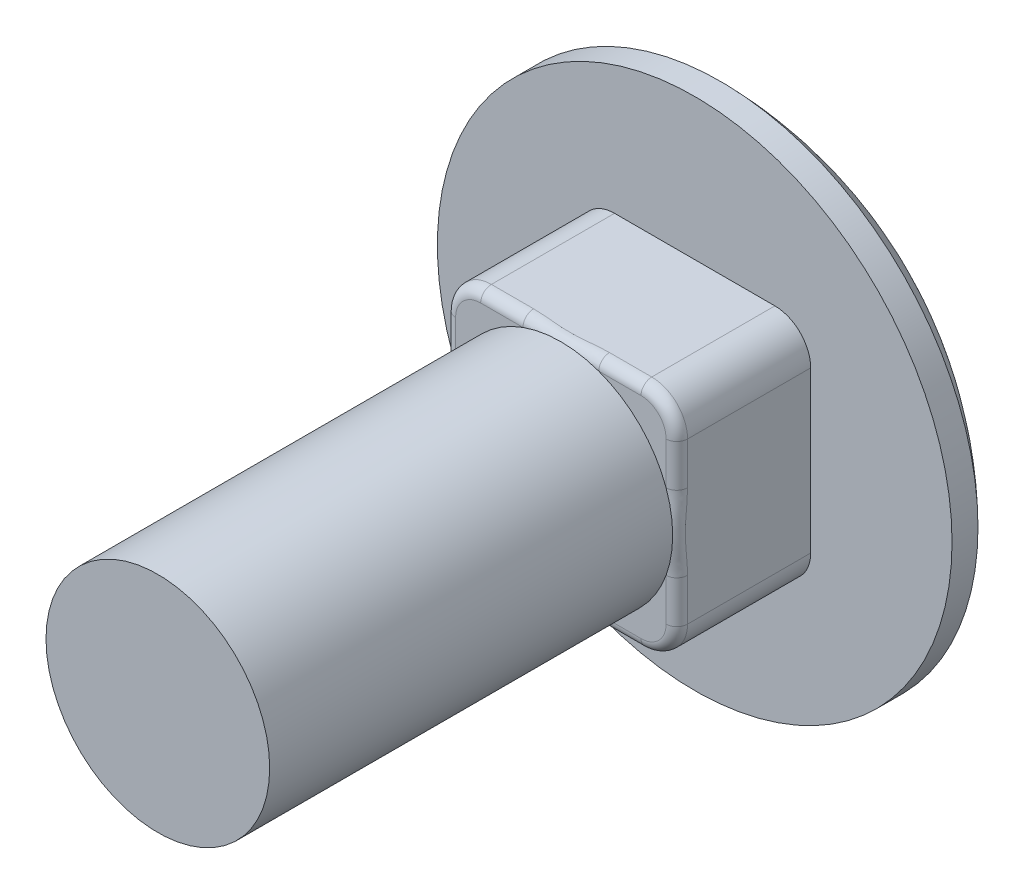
ISO-10303-21;
HEADER;
FILE_DESCRIPTION(('STEP AP214'),'2;1');
FILE_NAME('part.step','',(''),(''),'','','');
FILE_SCHEMA(('AUTOMOTIVE_DESIGN { 1 0 10303 214 1 1 1 1 }'));
ENDSEC;
DATA;
#1=APPLICATION_CONTEXT('core data for automotive mechanical design processes');
#2=APPLICATION_PROTOCOL_DEFINITION('international standard','automotive_design',2000,#1);
#3=PRODUCT_CONTEXT('',#1,'mechanical');
#4=PRODUCT('Part','Part','',(#3));
#5=PRODUCT_RELATED_PRODUCT_CATEGORY('part','',(#4));
#6=PRODUCT_DEFINITION_FORMATION('','',#4);
#7=PRODUCT_DEFINITION_CONTEXT('part definition',#1,'design');
#8=PRODUCT_DEFINITION('design','',#6,#7);
#9=PRODUCT_DEFINITION_SHAPE('','',#8);
#10=(LENGTH_UNIT() NAMED_UNIT(*) SI_UNIT(.MILLI.,.METRE.));
#11=(NAMED_UNIT(*) PLANE_ANGLE_UNIT() SI_UNIT($,.RADIAN.));
#12=(NAMED_UNIT(*) SI_UNIT($,.STERADIAN.) SOLID_ANGLE_UNIT());
#13=UNCERTAINTY_MEASURE_WITH_UNIT(LENGTH_MEASURE(1.E-05),#10,'distance_accuracy_value','');
#14=(GEOMETRIC_REPRESENTATION_CONTEXT(3) GLOBAL_UNCERTAINTY_ASSIGNED_CONTEXT((#13)) GLOBAL_UNIT_ASSIGNED_CONTEXT((#10,
#11,#12)) REPRESENTATION_CONTEXT('',''));
#15=CARTESIAN_POINT('',(0.,0.,0.));
#16=DIRECTION('',(0.,0.,1.));
#17=DIRECTION('',(1.,0.,0.));
#18=AXIS2_PLACEMENT_3D('',#15,#16,#17);
#19=CARTESIAN_POINT('',(-4.11480000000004,-4.1148,4.7498));
#20=DIRECTION('',(0.,0.,1.));
#21=DIRECTION('',(1.,0.,0.));
#22=AXIS2_PLACEMENT_3D('',#19,#20,#21);
#23=PLANE('',#22);
#24=CARTESIAN_POINT('',(2.84479999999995,-2.8448,4.7498));
#25=DIRECTION('',(0.,0.,1.));
#26=DIRECTION('',(1.,0.,0.));
#27=AXIS2_PLACEMENT_3D('',#24,#25,#26);
#28=CIRCLE('',#27,0.889);
#29=CARTESIAN_POINT('',(2.84479999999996,-3.7338,4.7498));
#30=VERTEX_POINT('',#29);
#31=CARTESIAN_POINT('',(3.73379999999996,-2.8448,4.7498));
#32=VERTEX_POINT('',#31);
#33=EDGE_CURVE('E505',#30,#32,#28,.T.);
#34=ORIENTED_EDGE('',*,*,#33,.T.);
#35=DIRECTION('',(0.,1.,0.));
#36=VECTOR('',#35,1.);
#37=CARTESIAN_POINT('',(3.73379999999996,2.8448,4.7498));
#38=LINE('',#37,#36);
#39=CARTESIAN_POINT('',(3.73379999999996,-1.34525615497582,4.7498));
#40=VERTEX_POINT('',#39);
#41=EDGE_CURVE('E506',#32,#40,#38,.T.);
#42=ORIENTED_EDGE('',*,*,#41,.T.);
#43=CARTESIAN_POINT('',(0.,0.,4.7498));
#44=DIRECTION('',(0.,0.,1.));
#45=DIRECTION('',(1.,0.,0.));
#46=AXIS2_PLACEMENT_3D('',#43,#44,#45);
#47=CIRCLE('',#46,3.96875);
#48=CARTESIAN_POINT('',(1.3452561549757,-3.7338,4.7498));
#49=VERTEX_POINT('',#48);
#50=EDGE_CURVE('E448',#49,#40,#47,.T.);
#51=ORIENTED_EDGE('',*,*,#50,.F.);
#52=DIRECTION('',(1.,0.,0.));
#53=VECTOR('',#52,1.);
#54=CARTESIAN_POINT('',(2.84479999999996,-3.7338,4.7498));
#55=LINE('',#54,#53);
#56=EDGE_CURVE('E503',#49,#30,#55,.T.);
#57=ORIENTED_EDGE('',*,*,#56,.T.);
#58=EDGE_LOOP('',(#34,#42,#51,#57));
#59=FACE_BOUND('',#58,.T.);
#60=ADVANCED_FACE('F38',(#59),#23,.T.);
#61=CARTESIAN_POINT('',(-2.84480000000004,-2.8448,4.7498));
#62=DIRECTION('',(0.,0.,1.));
#63=DIRECTION('',(1.,0.,0.));
#64=AXIS2_PLACEMENT_3D('',#61,#62,#63);
#65=CIRCLE('',#64,0.889);
#66=CARTESIAN_POINT('',(-3.73380000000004,-2.8448,4.7498));
#67=VERTEX_POINT('',#66);
#68=CARTESIAN_POINT('',(-2.84480000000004,-3.7338,4.7498));
#69=VERTEX_POINT('',#68);
#70=EDGE_CURVE('E499',#67,#69,#65,.T.);
#71=ORIENTED_EDGE('',*,*,#70,.T.);
#72=DIRECTION('',(1.,0.,0.));
#73=VECTOR('',#72,1.);
#74=CARTESIAN_POINT('',(2.84479999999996,-3.7338,4.7498));
#75=LINE('',#74,#73);
#76=CARTESIAN_POINT('',(-1.3452561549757,-3.7338,4.7498));
#77=VERTEX_POINT('',#76);
#78=EDGE_CURVE('E501',#69,#77,#75,.T.);
#79=ORIENTED_EDGE('',*,*,#78,.T.);
#80=CARTESIAN_POINT('',(-3.73380000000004,-1.34525615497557,4.7498));
#81=VERTEX_POINT('',#80);
#82=EDGE_CURVE('E586',#81,#77,#47,.T.);
#83=ORIENTED_EDGE('',*,*,#82,.F.);
#84=DIRECTION('',(0.,-1.,0.));
#85=VECTOR('',#84,1.);
#86=CARTESIAN_POINT('',(-3.73380000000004,-2.8448,4.7498));
#87=LINE('',#86,#85);
#88=EDGE_CURVE('E444',#81,#67,#87,.T.);
#89=ORIENTED_EDGE('',*,*,#88,.T.);
#90=EDGE_LOOP('',(#71,#79,#83,#89));
#91=FACE_BOUND('',#90,.T.);
#92=ADVANCED_FACE('F198',(#91),#23,.T.);
#93=CARTESIAN_POINT('',(-2.84480000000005,2.8448,4.7498));
#94=DIRECTION('',(0.,0.,1.));
#95=DIRECTION('',(1.,0.,0.));
#96=AXIS2_PLACEMENT_3D('',#93,#94,#95);
#97=CIRCLE('',#96,0.889);
#98=CARTESIAN_POINT('',(-2.84480000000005,3.7338,4.7498));
#99=VERTEX_POINT('',#98);
#100=CARTESIAN_POINT('',(-3.73380000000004,2.8448,4.7498));
#101=VERTEX_POINT('',#100);
#102=EDGE_CURVE('E495',#99,#101,#97,.T.);
#103=ORIENTED_EDGE('',*,*,#102,.T.);
#104=DIRECTION('',(0.,-1.,0.));
#105=VECTOR('',#104,1.);
#106=CARTESIAN_POINT('',(-3.73380000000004,-2.8448,4.7498));
#107=LINE('',#106,#105);
#108=CARTESIAN_POINT('',(-3.73380000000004,1.34525615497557,4.7498));
#109=VERTEX_POINT('',#108);
#110=EDGE_CURVE('E426',#101,#109,#107,.T.);
#111=ORIENTED_EDGE('',*,*,#110,.T.);
#112=CARTESIAN_POINT('',(-1.3452561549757,3.7338,4.7498));
#113=VERTEX_POINT('',#112);
#114=EDGE_CURVE('E583',#113,#109,#47,.T.);
#115=ORIENTED_EDGE('',*,*,#114,.F.);
#116=DIRECTION('',(-1.,0.,0.));
#117=VECTOR('',#116,1.);
#118=CARTESIAN_POINT('',(-2.84480000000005,3.7338,4.7498));
#119=LINE('',#118,#117);
#120=EDGE_CURVE('E244',#113,#99,#119,.T.);
#121=ORIENTED_EDGE('',*,*,#120,.T.);
#122=EDGE_LOOP('',(#103,#111,#115,#121));
#123=FACE_BOUND('',#122,.T.);
#124=ADVANCED_FACE('F205',(#123),#23,.T.);
#125=CARTESIAN_POINT('',(3.73379999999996,1.34525615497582,4.7498));
#126=VERTEX_POINT('',#125);
#127=CARTESIAN_POINT('',(1.3452561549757,3.7338,4.7498));
#128=VERTEX_POINT('',#127);
#129=EDGE_CURVE('E221',#126,#128,#47,.T.);
#130=ORIENTED_EDGE('',*,*,#129,.F.);
#131=DIRECTION('',(0.,1.,0.));
#132=VECTOR('',#131,1.);
#133=CARTESIAN_POINT('',(3.73379999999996,2.8448,4.7498));
#134=LINE('',#133,#132);
#135=CARTESIAN_POINT('',(3.73379999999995,2.8448,4.7498));
#136=VERTEX_POINT('',#135);
#137=EDGE_CURVE('E223',#126,#136,#134,.T.);
#138=ORIENTED_EDGE('',*,*,#137,.T.);
#139=CARTESIAN_POINT('',(2.84479999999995,2.8448,4.7498));
#140=DIRECTION('',(0.,0.,1.));
#141=DIRECTION('',(1.,0.,0.));
#142=AXIS2_PLACEMENT_3D('',#139,#140,#141);
#143=CIRCLE('',#142,0.889);
#144=CARTESIAN_POINT('',(2.84479999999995,3.7338,4.7498));
#145=VERTEX_POINT('',#144);
#146=EDGE_CURVE('E491',#136,#145,#143,.T.);
#147=ORIENTED_EDGE('',*,*,#146,.T.);
#148=DIRECTION('',(-1.,0.,0.));
#149=VECTOR('',#148,1.);
#150=CARTESIAN_POINT('',(-2.84480000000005,3.7338,4.7498));
#151=LINE('',#150,#149);
#152=EDGE_CURVE('E226',#145,#128,#151,.T.);
#153=ORIENTED_EDGE('',*,*,#152,.T.);
#154=EDGE_LOOP('',(#130,#138,#147,#153));
#155=FACE_BOUND('',#154,.T.);
#156=ADVANCED_FACE('F201',(#155),#23,.T.);
#157=CARTESIAN_POINT('',(0.,0.,0.));
#158=DIRECTION('',(0.,0.,-1.));
#159=DIRECTION('',(-1.,0.,0.));
#160=AXIS2_PLACEMENT_3D('',#157,#158,#159);
#161=PLANE('',#160);
#162=CARTESIAN_POINT('',(0.,0.,0.));
#163=DIRECTION('',(0.,0.,1.));
#164=DIRECTION('',(1.,0.,0.));
#165=AXIS2_PLACEMENT_3D('',#162,#163,#164);
#166=CIRCLE('',#165,9.1313);
#167=CARTESIAN_POINT('',(9.1313,0.,0.));
#168=VERTEX_POINT('',#167);
#169=EDGE_CURVE('E467',#168,#168,#166,.T.);
#170=ORIENTED_EDGE('',*,*,#169,.T.);
#171=EDGE_LOOP('',(#170));
#172=FACE_BOUND('',#171,.T.);
#173=DIRECTION('',(0.,-1.,0.));
#174=VECTOR('',#173,1.);
#175=CARTESIAN_POINT('',(-4.11480000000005,4.1148,0.));
#176=LINE('',#175,#174);
#177=CARTESIAN_POINT('',(-4.11480000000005,2.8448,0.));
#178=VERTEX_POINT('',#177);
#179=CARTESIAN_POINT('',(-4.11480000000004,-2.8448,0.));
#180=VERTEX_POINT('',#179);
#181=EDGE_CURVE('E453',#178,#180,#176,.T.);
#182=ORIENTED_EDGE('',*,*,#181,.F.);
#183=CARTESIAN_POINT('',(-2.84480000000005,2.8448,0.));
#184=DIRECTION('',(0.,0.,-1.));
#185=DIRECTION('',(-1.,0.,0.));
#186=AXIS2_PLACEMENT_3D('',#183,#184,#185);
#187=CIRCLE('',#186,1.27);
#188=CARTESIAN_POINT('',(-2.84480000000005,4.1148,0.));
#189=VERTEX_POINT('',#188);
#190=EDGE_CURVE('E413',#178,#189,#187,.T.);
#191=ORIENTED_EDGE('',*,*,#190,.T.);
#192=DIRECTION('',(-1.,0.,0.));
#193=VECTOR('',#192,1.);
#194=CARTESIAN_POINT('',(-4.11480000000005,4.1148,0.));
#195=LINE('',#194,#193);
#196=CARTESIAN_POINT('',(2.84479999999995,4.1148,0.));
#197=VERTEX_POINT('',#196);
#198=EDGE_CURVE('E461',#197,#189,#195,.T.);
#199=ORIENTED_EDGE('',*,*,#198,.F.);
#200=CARTESIAN_POINT('',(2.84479999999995,2.8448,0.));
#201=DIRECTION('',(0.,0.,-1.));
#202=DIRECTION('',(-1.,0.,0.));
#203=AXIS2_PLACEMENT_3D('',#200,#201,#202);
#204=CIRCLE('',#203,1.27);
#205=CARTESIAN_POINT('',(4.11479999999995,2.8448,0.));
#206=VERTEX_POINT('',#205);
#207=EDGE_CURVE('E489',#197,#206,#204,.T.);
#208=ORIENTED_EDGE('',*,*,#207,.T.);
#209=DIRECTION('',(0.,1.,0.));
#210=VECTOR('',#209,1.);
#211=CARTESIAN_POINT('',(4.11479999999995,4.1148,0.));
#212=LINE('',#211,#210);
#213=CARTESIAN_POINT('',(4.11479999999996,-2.8448,0.));
#214=VERTEX_POINT('',#213);
#215=EDGE_CURVE('E458',#214,#206,#212,.T.);
#216=ORIENTED_EDGE('',*,*,#215,.F.);
#217=CARTESIAN_POINT('',(2.84479999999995,-2.8448,0.));
#218=DIRECTION('',(0.,0.,-1.));
#219=DIRECTION('',(-1.,0.,0.));
#220=AXIS2_PLACEMENT_3D('',#217,#218,#219);
#221=CIRCLE('',#220,1.27);
#222=CARTESIAN_POINT('',(2.84479999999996,-4.1148,0.));
#223=VERTEX_POINT('',#222);
#224=EDGE_CURVE('E487',#214,#223,#221,.T.);
#225=ORIENTED_EDGE('',*,*,#224,.T.);
#226=DIRECTION('',(1.,0.,0.));
#227=VECTOR('',#226,1.);
#228=CARTESIAN_POINT('',(-4.11480000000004,-4.1148,0.));
#229=LINE('',#228,#227);
#230=CARTESIAN_POINT('',(-2.84480000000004,-4.1148,0.));
#231=VERTEX_POINT('',#230);
#232=EDGE_CURVE('E455',#231,#223,#229,.T.);
#233=ORIENTED_EDGE('',*,*,#232,.F.);
#234=CARTESIAN_POINT('',(-2.84480000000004,-2.8448,0.));
#235=DIRECTION('',(0.,0.,-1.));
#236=DIRECTION('',(-1.,0.,0.));
#237=AXIS2_PLACEMENT_3D('',#234,#235,#236);
#238=CIRCLE('',#237,1.27);
#239=EDGE_CURVE('E485',#231,#180,#238,.T.);
#240=ORIENTED_EDGE('',*,*,#239,.T.);
#241=EDGE_LOOP('',(#182,#191,#199,#208,#216,#225,#233,#240));
#242=FACE_BOUND('',#241,.T.);
#243=ADVANCED_FACE('F193',(#172,#242),#161,.F.);
#244=CARTESIAN_POINT('',(0.,0.,0.));
#245=DIRECTION('',(0.,0.,1.));
#246=DIRECTION('',(1.,0.,0.));
#247=AXIS2_PLACEMENT_3D('',#244,#245,#246);
#248=CYLINDRICAL_SURFACE('',#247,9.1313);
#249=ORIENTED_EDGE('',*,*,#169,.F.);
#250=EDGE_LOOP('',(#249));
#251=FACE_BOUND('',#250,.T.);
#252=CARTESIAN_POINT('',(0.,0.,-0.92075));
#253=DIRECTION('',(0.,0.,1.));
#254=DIRECTION('',(1.,0.,0.));
#255=AXIS2_PLACEMENT_3D('',#252,#253,#254);
#256=CIRCLE('',#255,9.1313);
#257=CARTESIAN_POINT('',(9.1313,0.,-0.92075));
#258=VERTEX_POINT('',#257);
#259=EDGE_CURVE('E464',#258,#258,#256,.T.);
#260=ORIENTED_EDGE('',*,*,#259,.T.);
#261=EDGE_LOOP('',(#260));
#262=FACE_BOUND('',#261,.T.);
#263=ADVANCED_FACE('F183',(#251,#262),#248,.T.);
#264=CARTESIAN_POINT('',(0.320228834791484,0.,8.22556209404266));
#265=DIRECTION('',(0.,-1.,0.));
#266=DIRECTION('',(1.,0.,0.));
#267=AXIS2_PLACEMENT_3D('',#264,#265,#266);
#268=CIRCLE('',#267,12.7);
#269=TRIMMED_CURVE('',#268,(PARAMETER_VALUE(-1.5960138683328)),
(PARAMETER_VALUE(1.5960138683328)),.T.,.PARAMETER.);
#270=CARTESIAN_POINT('',(0.,0.,8.22556209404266));
#271=DIRECTION('',(0.,0.,1.));
#272=AXIS1_PLACEMENT('',#270,#271);
#273=SURFACE_OF_REVOLUTION('',#269,#272);
#274=ORIENTED_EDGE('',*,*,#259,.F.);
#275=EDGE_LOOP('',(#274));
#276=FACE_BOUND('',#275,.T.);
#277=CARTESIAN_POINT('',(0.,0.,-4.4704));
#278=VERTEX_POINT('',#277);
#279=VERTEX_LOOP('',#278);
#280=FACE_BOUND('',#279,.T.);
#281=ADVANCED_FACE('F180',(#276,#280),#273,.T.);
#282=CARTESIAN_POINT('',(-4.11480000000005,4.1148,4.7498));
#283=DIRECTION('',(1.,0.,0.));
#284=DIRECTION('',(0.,1.,0.));
#285=AXIS2_PLACEMENT_3D('',#282,#283,#284);
#286=PLANE('',#285);
#287=DIRECTION('',(0.,0.,-1.));
#288=VECTOR('',#287,1.);
#289=CARTESIAN_POINT('',(-4.11480000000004,-2.8448,4.7498));
#290=LINE('',#289,#288);
#291=CARTESIAN_POINT('',(-4.11480000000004,-2.8448,4.3688));
#292=VERTEX_POINT('',#291);
#293=EDGE_CURVE('E417',#180,#292,#290,.F.);
#294=ORIENTED_EDGE('',*,*,#293,.T.);
#295=DIRECTION('',(0.,-1.,0.));
#296=VECTOR('',#295,1.);
#297=CARTESIAN_POINT('',(-4.11480000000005,2.8448,4.3688));
#298=LINE('',#297,#296);
#299=CARTESIAN_POINT('',(-4.11480000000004,-1.34525615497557,4.3688));
#300=VERTEX_POINT('',#299);
#301=EDGE_CURVE('E349',#292,#300,#298,.F.);
#302=ORIENTED_EDGE('',*,*,#301,.T.);
#303=CARTESIAN_POINT('',(-4.11480000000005,1.92293445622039,4.44690922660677));
#304=CARTESIAN_POINT('',(-4.11480000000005,1.84844319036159,4.66012462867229));
#305=CARTESIAN_POINT('',(-3.91665918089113,1.81269145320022,4.76245637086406));
#306=CARTESIAN_POINT('',(-3.71851836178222,1.77693971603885,4.86478811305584));
#307=CARTESIAN_POINT('',(-3.52832482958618,1.81711322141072,4.7498));
#308=CARTESIAN_POINT('',(-4.11480000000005,1.88940177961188,4.43525110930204));
#309=CARTESIAN_POINT('',(-4.11480000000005,1.82458174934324,4.64631769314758));
#310=CARTESIAN_POINT('',(-3.92337164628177,1.79196673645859,4.75128456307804));
#311=CARTESIAN_POINT('',(-3.73186903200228,1.75962883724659,4.85638033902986));
#312=CARTESIAN_POINT('',(-3.54122389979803,1.79207592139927,4.7498));
#313=CARTESIAN_POINT('',(-4.11480000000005,1.85532432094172,4.42536743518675));
#314=CARTESIAN_POINT('',(-4.11480000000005,1.7985193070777,4.63360252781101));
#315=CARTESIAN_POINT('',(-3.92977073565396,1.76897536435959,4.7406766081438));
#316=CARTESIAN_POINT('',(-3.74467840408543,1.73969987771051,4.84785481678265));
#317=CARTESIAN_POINT('',(-3.55420578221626,1.76620545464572,4.7498));
#318=CARTESIAN_POINT('',(-4.11480000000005,1.78650622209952,4.40854081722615));
#319=CARTESIAN_POINT('',(-4.11480000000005,1.74347635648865,4.61049035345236));
#320=CARTESIAN_POINT('',(-3.94198262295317,1.71962829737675,4.72078684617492));
#321=CARTESIAN_POINT('',(-3.76910043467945,1.69602869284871,4.83118750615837));
#322=CARTESIAN_POINT('',(-3.58010796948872,1.71308665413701,4.7498));
#323=CARTESIAN_POINT('',(-4.11480000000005,1.75176689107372,4.40159259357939));
#324=CARTESIAN_POINT('',(-4.11480000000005,1.71450108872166,4.60005254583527));
#325=CARTESIAN_POINT('',(-3.94779645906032,1.69327875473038,4.71150267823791));
#326=CARTESIAN_POINT('',(-3.78074100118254,1.67230880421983,4.82303192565));
#327=CARTESIAN_POINT('',(-3.5930283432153,1.68584089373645,4.7498));
#328=CARTESIAN_POINT('',(-4.11480000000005,1.6822396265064,4.3900429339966));
#329=CARTESIAN_POINT('',(-4.11480000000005,1.6549513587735,4.58144696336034));
#330=CARTESIAN_POINT('',(-3.95885256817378,1.63854692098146,4.69449359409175));
#331=CARTESIAN_POINT('',(-3.80285526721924,1.62239389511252,4.8076176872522));
#332=CARTESIAN_POINT('',(-3.61851402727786,1.63041647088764,4.7498));
#333=CARTESIAN_POINT('',(-4.11480000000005,1.64745489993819,4.38542108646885));
#334=CARTESIAN_POINT('',(-4.11480000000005,1.6243837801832,4.57323187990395));
#335=CARTESIAN_POINT('',(-3.96409948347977,1.61018489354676,4.68675548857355));
#336=CARTESIAN_POINT('',(-3.81335785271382,1.59622490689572,4.80033740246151));
#337=CARTESIAN_POINT('',(-3.63108147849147,1.60224831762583,4.7498));
#338=CARTESIAN_POINT('',(-4.11480000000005,1.57769475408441,4.37802776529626));
#339=CARTESIAN_POINT('',(-4.11480000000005,1.56197178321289,4.55869082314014));
#340=CARTESIAN_POINT('',(-3.97412867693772,1.55179985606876,4.67264917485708));
#341=CARTESIAN_POINT('',(-3.83341686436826,1.54186408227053,4.78666400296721));
#342=CARTESIAN_POINT('',(-3.65585937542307,1.54487723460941,4.7498));
#343=CARTESIAN_POINT('',(-4.11480000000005,1.54271933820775,4.37525625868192));
#344=CARTESIAN_POINT('',(-4.11480000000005,1.53011129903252,4.55234341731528));
#345=CARTESIAN_POINT('',(-3.97891096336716,1.52177687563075,4.66628094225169));
#346=CARTESIAN_POINT('',(-3.84298942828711,1.51366562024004,4.78025792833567));
#347=CARTESIAN_POINT('',(-3.6680698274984,1.51567432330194,4.7498));
#348=CARTESIAN_POINT('',(-4.11480000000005,1.42446188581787,4.3684304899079));
#349=CARTESIAN_POINT('',(-4.11480000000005,1.42158530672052,4.53377995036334));
#350=CARTESIAN_POINT('',(-3.99435088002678,1.41832323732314,4.64689981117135));
#351=CARTESIAN_POINT('',(-3.87371427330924,1.41630468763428,4.76025814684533));
#352=CARTESIAN_POINT('',(-3.70853568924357,1.41545656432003,4.7498));
#353=CARTESIAN_POINT('',(-4.11480000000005,1.34098502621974,4.36786573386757));
#354=CARTESIAN_POINT('',(-4.11480000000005,1.34218416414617,4.5251527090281));
#355=CARTESIAN_POINT('',(-4.00403019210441,1.34205214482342,4.63681344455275));
#356=CARTESIAN_POINT('',(-3.8931439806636,1.34295149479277,4.74857654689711));
#357=CARTESIAN_POINT('',(-3.73573040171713,1.34224358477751,4.7498));
#358=CARTESIAN_POINT('',(-4.11480000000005,1.17414361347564,4.37192356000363));
#359=CARTESIAN_POINT('',(-4.11480000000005,1.18126790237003,4.51433166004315));
#360=CARTESIAN_POINT('',(-4.02138988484,1.18566018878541,4.62193866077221));
#361=CARTESIAN_POINT('',(-3.92786782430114,1.1910780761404,4.72963898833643));
#362=CARTESIAN_POINT('',(-3.78657101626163,1.19130879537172,4.7498));
#363=CARTESIAN_POINT('',(-4.11480000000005,1.09077932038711,4.37655245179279));
#364=CARTESIAN_POINT('',(-4.11480000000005,1.09951281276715,4.51204408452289));
#365=CARTESIAN_POINT('',(-4.02906782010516,1.10553475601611,4.61715670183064));
#366=CARTESIAN_POINT('',(-3.94326795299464,1.11236881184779,4.72229960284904));
#367=CARTESIAN_POINT('',(-3.8102125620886,1.1135816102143,4.7498));
#368=CARTESIAN_POINT('',(-4.11480000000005,0.923970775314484,4.38855341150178));
#369=CARTESIAN_POINT('',(-4.11480000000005,0.934647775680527,4.51144737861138));
#370=CARTESIAN_POINT('',(-4.04264532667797,0.942545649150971,4.61117739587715));
#371=CARTESIAN_POINT('',(-3.97042339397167,0.951251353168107,4.7109365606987));
#372=CARTESIAN_POINT('',(-3.85326852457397,0.954016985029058,4.7498));
#373=CARTESIAN_POINT('',(-4.11480000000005,0.840527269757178,4.39593505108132));
#374=CARTESIAN_POINT('',(-4.11480000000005,0.851312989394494,4.51311194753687));
#375=CARTESIAN_POINT('',(-4.04853856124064,0.859673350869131,4.60999268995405));
#376=CARTESIAN_POINT('',(-3.98224048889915,0.868638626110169,4.706875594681));
#377=CARTESIAN_POINT('',(-3.87266781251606,0.872166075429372,4.7498));
#378=CARTESIAN_POINT('',(-4.11480000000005,0.673718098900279,4.41115470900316));
#379=CARTESIAN_POINT('',(-4.11480000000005,0.683997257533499,4.51825228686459));
#380=CARTESIAN_POINT('',(-4.05861892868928,0.692210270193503,4.60964231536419));
#381=CARTESIAN_POINT('',(-4.0024019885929,0.701022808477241,4.70103270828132));
#382=CARTESIAN_POINT('',(-3.90651166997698,0.705259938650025,4.7498));
#383=CARTESIAN_POINT('',(-4.11480000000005,0.590352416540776,4.41899256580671));
#384=CARTESIAN_POINT('',(-4.11480000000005,0.599813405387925,4.52172086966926));
#385=CARTESIAN_POINT('',(-4.06280666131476,0.607620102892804,4.61047593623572));
#386=CARTESIAN_POINT('',(-4.0107974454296,0.615829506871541,4.69922645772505));
#387=CARTESIAN_POINT('',(-3.92095798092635,0.620205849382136,4.7498));
#388=CARTESIAN_POINT('',(-4.11480000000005,0.422811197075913,4.43295373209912));
#389=CARTESIAN_POINT('',(-4.11480000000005,0.430273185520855,4.52845913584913));
#390=CARTESIAN_POINT('',(-4.06954770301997,0.436479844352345,4.61266921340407));
#391=CARTESIAN_POINT('',(-4.02427943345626,0.44309239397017,4.69687347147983));
#392=CARTESIAN_POINT('',(-3.94448024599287,0.446934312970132,4.7498));
#393=CARTESIAN_POINT('',(-4.11480000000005,0.338634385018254,4.4390633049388));
#394=CARTESIAN_POINT('',(-4.11480000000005,0.344709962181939,4.5317363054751));
#395=CARTESIAN_POINT('',(-4.07208811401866,0.349919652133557,4.6140328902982));
#396=CARTESIAN_POINT('',(-4.02937222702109,0.355334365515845,4.69632768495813));
#397=CARTESIAN_POINT('',(-3.95351377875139,0.35869748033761,4.7498));
#398=CARTESIAN_POINT('',(-4.11480000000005,0.170097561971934,4.44750725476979));
#399=CARTESIAN_POINT('',(-4.11480000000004,0.173332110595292,4.53634460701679));
#400=CARTESIAN_POINT('',(-4.07548286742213,0.176048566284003,4.61602911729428));
#401=CARTESIAN_POINT('',(-4.03616174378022,0.178969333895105,4.69571071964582));
#402=CARTESIAN_POINT('',(-3.96563093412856,0.180796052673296,4.7498));
#403=CARTESIAN_POINT('',(-4.11480000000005,0.0857376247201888,4.44984294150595));
#404=CARTESIAN_POINT('',(-4.11480000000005,0.0873179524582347,4.53768636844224));
#405=CARTESIAN_POINT('',(-4.07633779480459,0.0887379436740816,4.61666192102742));
#406=CARTESIAN_POINT('',(-4.03787555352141,0.0901585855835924,4.69563754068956));
#407=CARTESIAN_POINT('',(-3.96871662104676,0.0911319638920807,4.7498));
#408=CARTESIAN_POINT('',(-4.11480000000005,-0.0828427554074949,4.44989164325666));
#409=CARTESIAN_POINT('',(-4.11480000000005,-0.0843686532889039,4.53771390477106));
#410=CARTESIAN_POINT('',(-4.07635612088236,-0.085741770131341,4.61667469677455));
#411=CARTESIAN_POINT('',(-4.03791227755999,-0.0871133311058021,4.69563542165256));
#412=CARTESIAN_POINT('',(-3.96878278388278,-0.0880549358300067,4.7498));
#413=CARTESIAN_POINT('',(-4.11480000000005,-0.1670631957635,4.4476123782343));
#414=CARTESIAN_POINT('',(-4.11480000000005,-0.170241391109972,4.5364041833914));
#415=CARTESIAN_POINT('',(-4.07552234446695,-0.172910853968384,4.61605676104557));
#416=CARTESIAN_POINT('',(-4.03624094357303,-0.175781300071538,4.69570623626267));
#417=CARTESIAN_POINT('',(-3.9657734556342,-0.177577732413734,4.7498));
#418=CARTESIAN_POINT('',(-4.11480000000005,-0.335323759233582,4.43927482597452));
#419=CARTESIAN_POINT('',(-4.11480000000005,-0.341345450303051,4.53184989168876));
#420=CARTESIAN_POINT('',(-4.07217566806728,-0.346511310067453,4.61408034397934));
#421=CARTESIAN_POINT('',(-4.02954731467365,-0.351879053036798,4.69630931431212));
#422=CARTESIAN_POINT('',(-3.95382472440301,-0.35521765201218,4.7498));
#423=CARTESIAN_POINT('',(-4.11480000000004,-0.419363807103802,4.43321518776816));
#424=CARTESIAN_POINT('',(-4.11480000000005,-0.426775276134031,4.5285947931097));
#425=CARTESIAN_POINT('',(-4.06966216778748,-0.432942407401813,4.61272159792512));
#426=CARTESIAN_POINT('',(-4.0245081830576,-0.439511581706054,4.6968435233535));
#427=CARTESIAN_POINT('',(-3.94488320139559,-0.443334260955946,4.7498));
#428=CARTESIAN_POINT('',(-4.11480000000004,-0.550039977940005,4.42236552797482));
#429=CARTESIAN_POINT('',(-4.11480000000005,-0.558886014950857,4.52334946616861));
#430=CARTESIAN_POINT('',(-4.06444134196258,-0.566450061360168,4.61100000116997));
#431=CARTESIAN_POINT('',(-4.01407802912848,-0.574139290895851,4.69864875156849));
#432=CARTESIAN_POINT('',(-3.92666024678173,-0.578532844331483,4.7498));
#433=CARTESIAN_POINT('',(-4.11480000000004,-0.59673409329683,4.41820438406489));
#434=CARTESIAN_POINT('',(-4.11480000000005,-0.606072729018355,4.52143330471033));
#435=CARTESIAN_POINT('',(-4.06231440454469,-0.613979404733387,4.61046272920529));
#436=CARTESIAN_POINT('',(-4.0098208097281,-0.622045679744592,4.69949096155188));
#437=CARTESIAN_POINT('',(-3.91928843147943,-0.626481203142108,4.7498));
#438=CARTESIAN_POINT('',(-4.11480000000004,-0.690114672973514,4.40970830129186));
#439=CARTESIAN_POINT('',(-4.11480000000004,-0.700167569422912,4.5178752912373));
#440=CARTESIAN_POINT('',(-4.05753341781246,-0.708564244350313,4.60980522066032));
#441=CARTESIAN_POINT('',(-4.00025867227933,-0.717121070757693,4.70173411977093));
#442=CARTESIAN_POINT('',(-3.90291844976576,-0.721474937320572,4.7498));
#443=CARTESIAN_POINT('',(-4.11480000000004,-0.736801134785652,4.40537333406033));
#444=CARTESIAN_POINT('',(-4.11480000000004,-0.747110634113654,4.51623305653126));
#445=CARTESIAN_POINT('',(-4.05487928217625,-0.755619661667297,4.60968505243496));
#446=CARTESIAN_POINT('',(-3.99494637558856,-0.764323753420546,4.70313791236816));
#447=CARTESIAN_POINT('',(-3.89392001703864,-0.768520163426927,4.7498));
#448=CARTESIAN_POINT('',(-4.11480000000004,-0.830271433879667,4.39691504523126));
#449=CARTESIAN_POINT('',(-4.11480000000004,-0.840747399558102,4.51357881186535));
#450=CARTESIAN_POINT('',(-4.04902850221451,-0.849235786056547,4.6101304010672));
#451=CARTESIAN_POINT('',(-3.98324471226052,-0.85792081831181,4.70668299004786));
#452=CARTESIAN_POINT('',(-3.8743770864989,-0.861653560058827,4.7498));
#453=CARTESIAN_POINT('',(-4.11480000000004,-0.87705530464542,4.39279208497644));
#454=CARTESIAN_POINT('',(-4.11480000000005,-0.887476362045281,4.51256946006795));
#455=CARTESIAN_POINT('',(-4.04583096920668,-0.895795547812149,4.61069705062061));
#456=CARTESIAN_POINT('',(-3.97684443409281,-0.904347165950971,4.70882999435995));
#457=CARTESIAN_POINT('',(-3.86383005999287,-0.907740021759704,4.7498));
#458=CARTESIAN_POINT('',(-4.11480000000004,-0.970672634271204,4.38516730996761));
#459=CARTESIAN_POINT('',(-4.11480000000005,-0.980535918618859,4.51156015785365));
#460=CARTESIAN_POINT('',(-4.03887845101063,-0.988219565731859,4.61279932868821));
#461=CARTESIAN_POINT('',(-3.96293935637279,-0.996136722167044,4.7140437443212));
#462=CARTESIAN_POINT('',(-3.84130809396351,-0.998762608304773,4.7498));
#463=CARTESIAN_POINT('',(-4.11480000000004,-1.01750609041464,4.381665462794));
#464=CARTESIAN_POINT('',(-4.11480000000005,-1.02690412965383,4.5115648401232));
#465=CARTESIAN_POINT('',(-4.03512349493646,-1.03408385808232,4.61433490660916));
#466=CARTESIAN_POINT('',(-3.95542309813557,-1.0415336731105,4.71711732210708));
#467=CARTESIAN_POINT('',(-3.82933322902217,-1.04369879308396,4.7498));
#468=CARTESIAN_POINT('',(-4.11480000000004,-1.12744404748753,4.37466368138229));
#469=CARTESIAN_POINT('',(-4.11480000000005,-1.13518605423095,4.51322102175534));
#470=CARTESIAN_POINT('',(-4.0256309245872,-1.14065900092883,4.61941412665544));
#471=CARTESIAN_POINT('',(-3.93641770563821,-1.14662505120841,4.72563144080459));
#472=CARTESIAN_POINT('',(-3.79970544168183,-1.14763146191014,4.7498));
#473=CARTESIAN_POINT('',(-4.11480000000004,-1.19057711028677,4.37158281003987));
#474=CARTESIAN_POINT('',(-4.11480000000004,-1.19686658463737,4.51545842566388));
#475=CARTESIAN_POINT('',(-4.01965662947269,-1.20102182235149,4.62346840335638));
#476=CARTESIAN_POINT('',(-3.92444892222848,-1.20576268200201,4.73153250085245));
#477=CARTESIAN_POINT('',(-3.78152060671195,-1.20611902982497,4.7498));
#478=CARTESIAN_POINT('',(-4.11480000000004,-1.31685076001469,4.36839693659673));
#479=CARTESIAN_POINT('',(-4.11480000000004,-1.31870320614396,4.52349988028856));
#480=CARTESIAN_POINT('',(-4.00656336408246,-1.31947005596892,4.63460113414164));
#481=CARTESIAN_POINT('',(-3.89826124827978,-1.32082563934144,4.74575865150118));
#482=CARTESIAN_POINT('',(-3.74312479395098,-1.32046321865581,4.7498));
#483=CARTESIAN_POINT('',(-4.11480000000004,-1.37999119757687,4.36828753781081));
#484=CARTESIAN_POINT('',(-4.11480000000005,-1.37896416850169,4.52934205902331));
#485=CARTESIAN_POINT('',(-3.99944610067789,-1.37755870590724,4.64167510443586));
#486=CARTESIAN_POINT('',(-3.88399788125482,-1.37683492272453,4.75411812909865));
#487=CARTESIAN_POINT('',(-3.72291685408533,-1.37632360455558,4.7498));
#488=CARTESIAN_POINT('',(-4.11480000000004,-1.47941785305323,4.37152149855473));
#489=CARTESIAN_POINT('',(-4.11480000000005,-1.47177021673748,4.54225813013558));
#490=CARTESIAN_POINT('',(-3.98720207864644,-1.46645809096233,4.6558292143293));
#491=CARTESIAN_POINT('',(-3.85957294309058,-1.46137442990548,4.76943583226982));
#492=CARTESIAN_POINT('',(-3.68976966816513,-1.46209027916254,4.7498));
#493=CARTESIAN_POINT('',(-4.11480000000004,-1.51574851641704,4.37342173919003));
#494=CARTESIAN_POINT('',(-4.11480000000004,-1.50540660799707,4.54780063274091));
#495=CARTESIAN_POINT('',(-3.98250943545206,-1.49839945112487,4.66163712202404));
#496=CARTESIAN_POINT('',(-3.85018014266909,-1.49163699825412,4.77552456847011));
#497=CARTESIAN_POINT('',(-3.67737792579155,-1.49296628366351,4.7498));
#498=CARTESIAN_POINT('',(-4.11480000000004,-1.58825773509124,4.37899184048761));
#499=CARTESIAN_POINT('',(-4.11480000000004,-1.57151230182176,4.56072098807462));
#500=CARTESIAN_POINT('',(-3.97265387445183,-1.56076020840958,4.67465555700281));
#501=CARTESIAN_POINT('',(-3.83046874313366,-1.55025527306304,4.78864185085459));
#502=CARTESIAN_POINT('',(-3.65215378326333,-1.5536500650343,4.7498));
#503=CARTESIAN_POINT('',(-4.11480000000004,-1.62443636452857,4.38266070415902));
#504=CARTESIAN_POINT('',(-4.11480000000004,-1.60400157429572,4.56811797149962));
#505=CARTESIAN_POINT('',(-3.96749122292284,-1.59118045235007,4.68186529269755));
#506=CARTESIAN_POINT('',(-3.82013478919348,-1.5786222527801,4.79568300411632));
#507=CARTESIAN_POINT('',(-3.63932163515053,-1.58345843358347,4.7498));
#508=CARTESIAN_POINT('',(-4.11480000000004,-1.69671491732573,4.39218734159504));
#509=CARTESIAN_POINT('',(-4.11480000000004,-1.66752276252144,4.58506805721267));
#510=CARTESIAN_POINT('',(-3.95661637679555,-1.65015954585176,4.69785878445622));
#511=CARTESIAN_POINT('',(-3.79838334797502,-1.6330597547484,4.8107218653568));
#512=CARTESIAN_POINT('',(-3.61325785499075,-1.64206431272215,4.7498));
#513=CARTESIAN_POINT('',(-4.11480000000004,-1.73281342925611,4.398056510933));
#514=CARTESIAN_POINT('',(-4.11480000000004,-1.69856134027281,4.59465950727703));
#515=CARTESIAN_POINT('',(-3.9509014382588,-1.6787077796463,4.70665060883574));
#516=CARTESIAN_POINT('',(-3.7869408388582,-1.65912093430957,4.81873985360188));
#517=CARTESIAN_POINT('',(-3.60002447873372,-1.6708556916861,4.7498));
#518=CARTESIAN_POINT('',(-4.11480000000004,-1.80451514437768,4.4125797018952));
#519=CARTESIAN_POINT('',(-4.11480000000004,-1.75814099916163,4.61618380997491));
#520=CARTESIAN_POINT('',(-3.93887481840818,-1.73285444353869,4.72575243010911));
#521=CARTESIAN_POINT('',(-3.76288953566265,-1.70785122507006,4.83541690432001));
#522=CARTESIAN_POINT('',(-3.57337813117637,-1.72711447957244,4.7498));
#523=CARTESIAN_POINT('',(-4.11480000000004,-1.84011716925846,4.42123945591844));
#524=CARTESIAN_POINT('',(-4.11480000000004,-1.78668431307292,4.62815761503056));
#525=CARTESIAN_POINT('',(-3.93256192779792,-1.75844665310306,4.73606552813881));
#526=CARTESIAN_POINT('',(-3.75025292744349,-1.73050546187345,4.84409317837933));
#527=CARTESIAN_POINT('',(-3.55996484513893,-1.75457902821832,4.7498));
#528=CARTESIAN_POINT('',(-4.11480000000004,-1.87528315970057,4.43158323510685));
#529=CARTESIAN_POINT('',(-4.11480000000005,-1.81329911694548,4.64133467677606));
#530=CARTESIAN_POINT('',(-3.92592659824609,-1.78204246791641,4.74710588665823));
#531=CARTESIAN_POINT('',(-3.73705319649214,-1.75078581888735,4.85287709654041));
#532=CARTESIAN_POINT('',(-3.54656708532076,-1.78124632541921,4.7498));
#533=(BOUNDED_SURFACE() B_SPLINE_SURFACE(3,2,((#303,#304,#305,#306,#307),(#308,#309,#310,#311,
#312),(#313,#314,#315,#316,#317),(#318,#319,#320,#321,#322),(#323,#324,#325,#326,#327),(#328,
#329,#330,#331,#332),(#333,#334,#335,#336,#337),(#338,#339,#340,#341,#342),(#343,#344,#345,#346,
#347),(#348,#349,#350,#351,#352),(#353,#354,#355,#356,#357),(#358,#359,#360,#361,#362),(#363,
#364,#365,#366,#367),(#368,#369,#370,#371,#372),(#373,#374,#375,#376,#377),(#378,#379,#380,#381,
#382),(#383,#384,#385,#386,#387),(#388,#389,#390,#391,#392),(#393,#394,#395,#396,#397),(#398,
#399,#400,#401,#402),(#403,#404,#405,#406,#407),(#408,#409,#410,#411,#412),(#413,#414,#415,#416,
#417),(#418,#419,#420,#421,#422),(#423,#424,#425,#426,#427),(#428,#429,#430,#431,#432),(#433,
#434,#435,#436,#437),(#438,#439,#440,#441,#442),(#443,#444,#445,#446,#447),(#448,#449,#450,#451,
#452),(#453,#454,#455,#456,#457),(#458,#459,#460,#461,#462),(#463,#464,#465,#466,#467),(#468,
#469,#470,#471,#472),(#473,#474,#475,#476,#477),(#478,#479,#480,#481,#482),(#483,#484,#485,#486,
#487),(#488,#489,#490,#491,#492),(#493,#494,#495,#496,#497),(#498,#499,#500,#501,#502),(#503,
#504,#505,#506,#507),(#508,#509,#510,#511,#512),(#513,#514,#515,#516,#517),(#518,#519,#520,#521,
#522),(#523,#524,#525,#526,#527),(#528,#529,#530,#531,#532)),.UNSPECIFIED.,.F.,.F.,
.F.) B_SPLINE_SURFACE_WITH_KNOTS((4,2,2,2,2,2,2,2,2,2,2,2,2,2,2,2,2,2,2,2,2,2,4),(3,2,3),(0.,
0.106358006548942,0.212523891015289,0.317741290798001,0.42295681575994,0.67306615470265,
0.923479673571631,1.17477215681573,1.42597619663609,1.67912407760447,1.93218408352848,
2.18482111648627,2.43754848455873,2.57818703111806,2.71884862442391,2.85974251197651,
3.00062904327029,3.19021429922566,3.37951902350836,3.48862521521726,3.59766997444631,
3.70728746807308,3.81713158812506),(0.,0.5,1.),
.UNSPECIFIED.) GEOMETRIC_REPRESENTATION_ITEM() RATIONAL_B_SPLINE_SURFACE(((1.,0.860216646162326,
1.,0.860216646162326,1.),(1.,0.865335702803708,1.,0.865335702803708,1.),(1.,0.870172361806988,
1.,0.870172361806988,1.),(1.,0.879333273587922,1.,0.879333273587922,1.),(1.,0.883658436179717,
1.,0.883658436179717,1.),(1.,0.891830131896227,1.,0.891830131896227,1.),(1.,0.895680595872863,
1.,0.895680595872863,1.),(1.,0.902997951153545,1.,0.902997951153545,1.),(1.,0.906464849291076,
1.,0.906464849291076,1.),(1.,0.917601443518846,1.,0.917601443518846,1.),(1.,0.924484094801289,
1.,0.924484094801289,1.),(1.,0.936723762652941,1.,0.936723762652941,1.),(1.,0.942078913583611,
1.,0.942078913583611,1.),(1.,0.951488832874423,1.,0.951488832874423,1.),(1.,0.955538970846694,
1.,0.955538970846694,1.),(1.,0.96243615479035,1.,0.96243615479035,1.),(1.,0.965283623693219,1.,
0.965283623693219,1.),(1.,0.969855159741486,1.,0.969855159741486,1.),(1.,0.971570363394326,1.,
0.971570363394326,1.),(1.,0.973860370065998,1.,0.973860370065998,1.),(1.,0.974435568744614,1.,
0.974435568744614,1.),(1.,0.974447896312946,1.,0.974447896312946,1.),(1.,0.973886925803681,1.,
0.973886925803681,1.),(1.,0.971629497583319,1.,0.971629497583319,1.),(1.,0.969932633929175,1.,
0.969932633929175,1.),(1.,0.966392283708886,1.,0.966392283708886,1.),(1.,0.964947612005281,1.,
0.964947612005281,1.),(1.,0.961691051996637,1.,0.961691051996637,1.),(1.,0.959879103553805,1.,
0.959879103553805,1.),(1.,0.955871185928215,1.,0.955871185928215,1.),(1.,0.953674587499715,1.,
0.953674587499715,1.),(1.,0.94887889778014,1.,0.94887889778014,1.),(1.,0.946279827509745,1.,
0.946279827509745,1.),(1.,0.9396779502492,1.,0.9396779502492,1.),(1.,0.935500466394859,1.,
0.935500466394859,1.),(1.,0.926271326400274,1.,0.926271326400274,1.),(1.,0.921220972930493,1.,
0.921220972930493,1.),(1.,0.912446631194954,1.,0.912446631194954,1.),(1.,0.909067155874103,1.,
0.909067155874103,1.),(1.,0.90192531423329,1.,0.90192531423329,1.),(1.,0.898163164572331,1.,
0.898163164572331,1.),(1.,0.890183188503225,1.,0.890183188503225,1.),(1.,0.885963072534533,1.,
0.885963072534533,1.),(1.,0.877010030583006,1.,0.877010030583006,1.),(1.,0.872276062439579,1.,
0.872276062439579,1.),(1.,0.867256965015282,1.,0.867256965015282,1.))) REPRESENTATION_ITEM('') SURFACE());
#534=CARTESIAN_POINT('',(-4.11480000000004,-1.87528315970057,4.43158323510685));
#535=CARTESIAN_POINT('',(-4.11480000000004,-1.84011716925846,4.42123945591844));
#536=CARTESIAN_POINT('',(-4.11480000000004,-1.80451514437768,4.4125797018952));
#537=CARTESIAN_POINT('',(-4.11480000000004,-1.73281342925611,4.398056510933));
#538=CARTESIAN_POINT('',(-4.11480000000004,-1.69671491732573,4.39218734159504));
#539=CARTESIAN_POINT('',(-4.11480000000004,-1.62443636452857,4.38266070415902));
#540=CARTESIAN_POINT('',(-4.11480000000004,-1.58825773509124,4.37899184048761));
#541=CARTESIAN_POINT('',(-4.11480000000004,-1.51574851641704,4.37342173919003));
#542=CARTESIAN_POINT('',(-4.11480000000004,-1.47941785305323,4.37152149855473));
#543=CARTESIAN_POINT('',(-4.11480000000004,-1.37999119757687,4.36828753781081));
#544=CARTESIAN_POINT('',(-4.11480000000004,-1.31685076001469,4.36839693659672));
#545=CARTESIAN_POINT('',(-4.11480000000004,-1.19057711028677,4.37158281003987));
#546=CARTESIAN_POINT('',(-4.11480000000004,-1.12744404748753,4.37466368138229));
#547=CARTESIAN_POINT('',(-4.11480000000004,-1.01750609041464,4.381665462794));
#548=CARTESIAN_POINT('',(-4.11480000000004,-0.970672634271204,4.38516730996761));
#549=CARTESIAN_POINT('',(-4.11480000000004,-0.87705530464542,4.39279208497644));
#550=CARTESIAN_POINT('',(-4.11480000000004,-0.830271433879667,4.39691504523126));
#551=CARTESIAN_POINT('',(-4.11480000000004,-0.736801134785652,4.40537333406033));
#552=CARTESIAN_POINT('',(-4.11480000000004,-0.690114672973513,4.40970830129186));
#553=CARTESIAN_POINT('',(-4.11480000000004,-0.59673409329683,4.41820438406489));
#554=CARTESIAN_POINT('',(-4.11480000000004,-0.550039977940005,4.42236552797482));
#555=CARTESIAN_POINT('',(-4.11480000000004,-0.419363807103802,4.43321518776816));
#556=CARTESIAN_POINT('',(-4.11480000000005,-0.335323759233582,4.43927482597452));
#557=CARTESIAN_POINT('',(-4.11480000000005,-0.1670631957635,4.4476123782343));
#558=CARTESIAN_POINT('',(-4.11480000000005,-0.082842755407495,4.44989164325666));
#559=CARTESIAN_POINT('',(-4.11480000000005,0.0857376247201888,4.44984294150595));
#560=CARTESIAN_POINT('',(-4.11480000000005,0.170097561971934,4.44750725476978));
#561=CARTESIAN_POINT('',(-4.11480000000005,0.338634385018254,4.4390633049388));
#562=CARTESIAN_POINT('',(-4.11480000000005,0.422811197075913,4.43295373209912));
#563=CARTESIAN_POINT('',(-4.11480000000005,0.590352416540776,4.41899256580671));
#564=CARTESIAN_POINT('',(-4.11480000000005,0.673718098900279,4.41115470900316));
#565=CARTESIAN_POINT('',(-4.11480000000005,0.840527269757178,4.39593505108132));
#566=CARTESIAN_POINT('',(-4.11480000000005,0.923970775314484,4.38855341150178));
#567=CARTESIAN_POINT('',(-4.11480000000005,1.09077932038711,4.37655245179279));
#568=CARTESIAN_POINT('',(-4.11480000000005,1.17414361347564,4.37192356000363));
#569=CARTESIAN_POINT('',(-4.11480000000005,1.34098502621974,4.36786573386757));
#570=CARTESIAN_POINT('',(-4.11480000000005,1.42446188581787,4.3684304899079));
#571=CARTESIAN_POINT('',(-4.11480000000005,1.54271933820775,4.37525625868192));
#572=CARTESIAN_POINT('',(-4.11480000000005,1.57769475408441,4.37802776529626));
#573=CARTESIAN_POINT('',(-4.11480000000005,1.64745489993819,4.38542108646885));
#574=CARTESIAN_POINT('',(-4.11480000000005,1.6822396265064,4.3900429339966));
#575=CARTESIAN_POINT('',(-4.11480000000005,1.75176689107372,4.4015925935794));
#576=CARTESIAN_POINT('',(-4.11480000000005,1.78650622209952,4.40854081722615));
#577=CARTESIAN_POINT('',(-4.11480000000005,1.85532432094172,4.42536743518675));
#578=CARTESIAN_POINT('',(-4.11480000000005,1.88940177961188,4.43525110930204));
#579=CARTESIAN_POINT('',(-4.11480000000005,1.92293445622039,4.44690922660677));
#580=B_SPLINE_CURVE_WITH_KNOTS('',3,(#534,#535,#536,#537,#538,#539,#540,#541,#542,#543,#544,
#545,#546,#547,#548,#549,#550,#551,#552,#553,#554,#555,#556,#557,#558,#559,#560,#561,#562,#563,
#564,#565,#566,#567,#568,#569,#570,#571,#572,#573,#574,#575,#576,#577,#578,#579),.UNSPECIFIED.,
.F.,.F.,(4,2,2,2,2,2,2,2,2,2,2,2,2,2,2,2,2,2,2,2,2,2,4),(0.,0.109844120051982,0.219461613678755,
0.3285063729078,0.437612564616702,0.626917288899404,0.816502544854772,0.95738907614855,
1.09828296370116,1.23894455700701,1.37958310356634,1.6323104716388,1.88494750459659,
2.13800751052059,2.39115539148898,2.64235943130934,2.89365191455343,3.14406543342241,
3.39417477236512,3.49939029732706,3.60460769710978,3.71077358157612,3.81713158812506),.UNSPECIFIED.);
#581=CARTESIAN_POINT('',(-4.11480000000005,1.34525615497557,4.3688));
#582=VERTEX_POINT('',#581);
#583=EDGE_CURVE('E343',#300,#582,#580,.T.);
#584=ORIENTED_EDGE('',*,*,#583,.T.);
#585=DIRECTION('',(0.,-1.,0.));
#586=VECTOR('',#585,1.);
#587=CARTESIAN_POINT('',(-4.11480000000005,2.8448,4.3688));
#588=LINE('',#587,#586);
#589=CARTESIAN_POINT('',(-4.11480000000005,2.8448,4.3688));
#590=VERTEX_POINT('',#589);
#591=EDGE_CURVE('E350',#582,#590,#588,.F.);
#592=ORIENTED_EDGE('',*,*,#591,.T.);
#593=DIRECTION('',(0.,0.,-1.));
#594=VECTOR('',#593,1.);
#595=CARTESIAN_POINT('',(-4.11480000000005,2.8448,4.7498));
#596=LINE('',#595,#594);
#597=EDGE_CURVE('E408',#590,#178,#596,.T.);
#598=ORIENTED_EDGE('',*,*,#597,.T.);
#599=ORIENTED_EDGE('',*,*,#181,.T.);
#600=EDGE_LOOP('',(#294,#302,#584,#592,#598,#599));
#601=FACE_BOUND('',#600,.T.);
#602=ADVANCED_FACE('F182',(#601),#286,.F.);
#603=CARTESIAN_POINT('',(-4.11480000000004,-4.1148,4.7498));
#604=DIRECTION('',(0.,1.,0.));
#605=DIRECTION('',(0.,0.,1.));
#606=AXIS2_PLACEMENT_3D('',#603,#604,#605);
#607=PLANE('',#606);
#608=DIRECTION('',(0.,0.,-1.));
#609=VECTOR('',#608,1.);
#610=CARTESIAN_POINT('',(2.84479999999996,-4.1148,4.7498));
#611=LINE('',#610,#609);
#612=CARTESIAN_POINT('',(2.84479999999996,-4.1148,4.3688));
#613=VERTEX_POINT('',#612);
#614=EDGE_CURVE('E474',#223,#613,#611,.F.);
#615=ORIENTED_EDGE('',*,*,#614,.T.);
#616=DIRECTION('',(1.,0.,0.));
#617=VECTOR('',#616,1.);
#618=CARTESIAN_POINT('',(-2.84480000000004,-4.1148,4.3688));
#619=LINE('',#618,#617);
#620=CARTESIAN_POINT('',(1.3452561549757,-4.1148,4.3688));
#621=VERTEX_POINT('',#620);
#622=EDGE_CURVE('E539',#613,#621,#619,.F.);
#623=ORIENTED_EDGE('',*,*,#622,.T.);
#624=CARTESIAN_POINT('',(-1.92293445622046,-4.1148,4.44690922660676));
#625=CARTESIAN_POINT('',(-1.84844319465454,-4.1148,4.66012463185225));
#626=CARTESIAN_POINT('',(-1.81269145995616,-3.91665917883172,4.76245637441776));
#627=CARTESIAN_POINT('',(-1.77693972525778,-3.71851835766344,4.86478811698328));
#628=CARTESIAN_POINT('',(-1.81711322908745,-3.52832482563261,4.7498));
#629=CARTESIAN_POINT('',(-1.88940177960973,-4.1148,4.43525110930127));
#630=CARTESIAN_POINT('',(-1.82458175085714,-4.1148,4.64631769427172));
#631=CARTESIAN_POINT('',(-1.79196673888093,-3.92337164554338,4.75128456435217));
#632=CARTESIAN_POINT('',(-1.75962884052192,-3.73186903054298,4.85638034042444));
#633=CARTESIAN_POINT('',(-1.79207592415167,-3.54122389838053,4.7498));
#634=CARTESIAN_POINT('',(-1.85532432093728,-4.1148,4.42536743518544));
#635=CARTESIAN_POINT('',(-1.7985193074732,-4.1148,4.6336025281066));
#636=CARTESIAN_POINT('',(-1.76897536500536,-3.92977073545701,4.74067660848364));
#637=CARTESIAN_POINT('',(-1.73969987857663,-3.74467840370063,4.84785481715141));
#638=CARTESIAN_POINT('',(-1.76620545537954,-3.5542057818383,4.7498));
#639=CARTESIAN_POINT('',(-1.78650622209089,-4.1148,4.40854081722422));
#640=CARTESIAN_POINT('',(-1.74347635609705,-4.1148,4.61049035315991));
#641=CARTESIAN_POINT('',(-1.7196282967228,-3.94198262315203,4.72078684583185));
#642=CARTESIAN_POINT('',(-1.69602869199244,-3.76910043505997,4.83118750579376));
#643=CARTESIAN_POINT('',(-1.71308665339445,-3.5801079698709,4.7498));
#644=CARTESIAN_POINT('',(-1.75176689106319,-4.1148,4.40159259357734));
#645=CARTESIAN_POINT('',(-1.7145010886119,-4.1148,4.60005254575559));
#646=CARTESIAN_POINT('',(-1.69327875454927,-3.94779645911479,4.71150267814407));
#647=CARTESIAN_POINT('',(-1.67230880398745,-3.7807410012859,4.82303192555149));
#648=CARTESIAN_POINT('',(-1.6858408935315,-3.59302834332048,4.7498));
#649=CARTESIAN_POINT('',(-1.68223962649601,-4.1148,4.39004293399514));
#650=CARTESIAN_POINT('',(-1.65495135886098,-4.1148,4.5814469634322));
#651=CARTESIAN_POINT('',(-1.63854692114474,-3.958852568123,4.69449359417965));
#652=CARTESIAN_POINT('',(-1.62239389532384,-3.80285526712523,4.80761768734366));
#653=CARTESIAN_POINT('',(-1.63041647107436,-3.61851402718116,4.7498));
#654=CARTESIAN_POINT('',(-1.64745489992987,-4.1148,4.38542108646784));
#655=CARTESIAN_POINT('',(-1.62438378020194,-4.1148,4.57323187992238));
#656=CARTESIAN_POINT('',(-1.61018489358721,-3.96409948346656,4.68675548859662));
#657=CARTESIAN_POINT('',(-1.59622490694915,-3.81335785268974,4.8003374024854));
#658=CARTESIAN_POINT('',(-1.60224831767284,-3.63108147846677,4.7498));
#659=CARTESIAN_POINT('',(-1.57769475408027,-4.1148,4.37802776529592));
#660=CARTESIAN_POINT('',(-1.56197178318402,-4.1148,4.55869082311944));
#661=CARTESIAN_POINT('',(-1.551799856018,-3.97412867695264,4.67264917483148));
#662=CARTESIAN_POINT('',(-1.54186408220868,-3.8334168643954,4.78666400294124));
#663=CARTESIAN_POINT('',(-1.54487723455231,-3.65585937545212,4.7498));
#664=CARTESIAN_POINT('',(-1.54271933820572,-4.1148,4.3752562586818));
#665=CARTESIAN_POINT('',(-1.53011129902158,-4.1148,4.5523434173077));
#666=CARTESIAN_POINT('',(-1.5217768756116,-3.97891096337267,4.66628094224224));
#667=CARTESIAN_POINT('',(-1.51366562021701,-3.84298942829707,4.78025792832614));
#668=CARTESIAN_POINT('',(-1.51567432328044,-3.66806982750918,4.7498));
#669=CARTESIAN_POINT('',(-1.42446188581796,-4.1148,4.3684304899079));
#670=CARTESIAN_POINT('',(-1.42158530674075,-4.1148,4.53377995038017));
#671=CARTESIAN_POINT('',(-1.41832323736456,-3.99435088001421,4.64689981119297));
#672=CARTESIAN_POINT('',(-1.41630468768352,-3.87371427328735,4.76025814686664));
#673=CARTESIAN_POINT('',(-1.41545656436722,-3.70853568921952,4.7498));
#674=CARTESIAN_POINT('',(-1.34098502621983,-4.1148,4.36786573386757));
#675=CARTESIAN_POINT('',(-1.34218416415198,-4.1148,4.52515270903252));
#676=CARTESIAN_POINT('',(-1.34205214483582,-4.0040301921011,4.6368134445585));
#677=CARTESIAN_POINT('',(-1.3429514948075,-3.89314398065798,4.74857654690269));
#678=CARTESIAN_POINT('',(-1.34224358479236,-3.73573040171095,4.7498));
#679=CARTESIAN_POINT('',(-1.17414361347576,-4.1148,4.37192356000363));
#680=CARTESIAN_POINT('',(-1.18126790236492,-4.1148,4.51433166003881));
#681=CARTESIAN_POINT('',(-1.1856601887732,-4.02138988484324,4.62193866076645));
#682=CARTESIAN_POINT('',(-1.19107807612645,-3.92786782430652,4.72963898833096));
#683=CARTESIAN_POINT('',(-1.19130879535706,-3.78657101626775,4.7498));
#684=CARTESIAN_POINT('',(-1.09077932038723,-4.1148,4.37655245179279));
#685=CARTESIAN_POINT('',(-1.09951281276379,-4.1148,4.51204408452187));
#686=CARTESIAN_POINT('',(-1.10553475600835,-4.02906782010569,4.61715670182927));
#687=CARTESIAN_POINT('',(-1.1123688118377,-3.94326795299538,4.72229960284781));
#688=CARTESIAN_POINT('',(-1.1135816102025,-3.81021256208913,4.7498));
#689=CARTESIAN_POINT('',(-0.923970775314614,-4.1148,4.38855341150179));
#690=CARTESIAN_POINT('',(-0.934647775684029,-4.1148,4.51144737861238));
#691=CARTESIAN_POINT('',(-0.942545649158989,-4.04264532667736,4.61117739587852));
#692=CARTESIAN_POINT('',(-0.951251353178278,-3.97042339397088,4.71093656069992));
#693=CARTESIAN_POINT('',(-0.954016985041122,-3.85326852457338,4.7498));
#694=CARTESIAN_POINT('',(-0.84052726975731,-4.1148,4.39593505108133));
#695=CARTESIAN_POINT('',(-0.851312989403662,-4.1148,4.51311194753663));
#696=CARTESIAN_POINT('',(-0.859673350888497,-4.04853856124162,4.60999268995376));
#697=CARTESIAN_POINT('',(-0.868638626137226,-3.98224048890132,4.7068755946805));
#698=CARTESIAN_POINT('',(-0.8721660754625,-3.87266781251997,4.7498));
#699=CARTESIAN_POINT('',(-0.673718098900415,-4.1148,4.41115470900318));
#700=CARTESIAN_POINT('',(-0.683997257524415,-4.1148,4.51825228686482));
#701=CARTESIAN_POINT('',(-0.692210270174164,-4.05861892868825,4.60964231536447));
#702=CARTESIAN_POINT('',(-0.701022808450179,-4.00240198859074,4.70103270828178));
#703=CARTESIAN_POINT('',(-0.705259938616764,-3.9065116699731,4.7498));
#704=CARTESIAN_POINT('',(-0.590352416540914,-4.1148,4.41899256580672));
#705=CARTESIAN_POINT('',(-0.599813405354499,-4.1148,4.52172086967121));
#706=CARTESIAN_POINT('',(-0.607620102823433,-4.06280666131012,4.61047593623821));
#707=CARTESIAN_POINT('',(-0.615829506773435,-4.01079744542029,4.69922645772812));
#708=CARTESIAN_POINT('',(-0.62020584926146,-3.92095798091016,4.7498));
#709=CARTESIAN_POINT('',(-0.422811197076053,-4.1148,4.43295373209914));
#710=CARTESIAN_POINT('',(-0.430273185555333,-4.1148,4.52845913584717));
#711=CARTESIAN_POINT('',(-0.436479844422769,-4.06954770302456,4.61266921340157));
#712=CARTESIAN_POINT('',(-0.443092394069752,-4.02427943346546,4.69687347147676));
#713=CARTESIAN_POINT('',(-0.446934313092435,-3.94448024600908,4.7498));
#714=CARTESIAN_POINT('',(-0.338634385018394,-4.1148,4.43906330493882));
#715=CARTESIAN_POINT('',(-0.344709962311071,-4.1148,4.53173630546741));
#716=CARTESIAN_POINT('',(-0.349919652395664,-4.07208811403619,4.61403289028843));
#717=CARTESIAN_POINT('',(-0.355334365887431,-4.02937222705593,4.69632768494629));
#718=CARTESIAN_POINT('',(-0.358697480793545,-3.95351377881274,4.7498));
#719=CARTESIAN_POINT('',(-0.170097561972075,-4.1148,4.44750725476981));
#720=CARTESIAN_POINT('',(-0.173332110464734,-4.1148,4.53634460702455));
#721=CARTESIAN_POINT('',(-0.176048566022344,-4.07548286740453,4.61602911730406));
#722=CARTESIAN_POINT('',(-0.178969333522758,-4.0361617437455,4.69571071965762));
#723=CARTESIAN_POINT('',(-0.180796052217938,-3.9656309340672,4.7498));
#724=CARTESIAN_POINT('',(-0.08573762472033,-4.1148,4.44984294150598));
#725=CARTESIAN_POINT('',(-0.0873179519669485,-4.1148,4.53768636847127));
#726=CARTESIAN_POINT('',(-0.0887379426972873,-4.07633779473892,4.61666192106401));
#727=CARTESIAN_POINT('',(-0.0901585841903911,-4.03787555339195,4.69563754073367));
#728=CARTESIAN_POINT('',(-0.0911319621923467,-3.96871662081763,4.7498));
#729=CARTESIAN_POINT('',(0.0828427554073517,-4.1148,4.4498916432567));
#730=CARTESIAN_POINT('',(0.0843686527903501,-4.1148,4.53771390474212));
#731=CARTESIAN_POINT('',(0.0857417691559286,-4.07635612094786,4.61667469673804));
#732=CARTESIAN_POINT('',(0.0871133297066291,-4.0379122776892,4.69563542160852));
#733=CARTESIAN_POINT('',(0.0880549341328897,-3.96878278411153,4.7498));
#734=CARTESIAN_POINT('',(0.167063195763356,-4.1148,4.44761237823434));
#735=CARTESIAN_POINT('',(0.170241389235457,-4.1148,4.53640418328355));
#736=CARTESIAN_POINT('',(0.172910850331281,-4.07552234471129,4.61605676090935));
#737=CARTESIAN_POINT('',(0.175781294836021,-4.03624094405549,4.6957062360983));
#738=CARTESIAN_POINT('',(0.177577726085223,-3.96577345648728,4.7498));
#739=CARTESIAN_POINT('',(0.335323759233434,-4.1148,4.43927482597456));
#740=CARTESIAN_POINT('',(0.341345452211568,-4.1148,4.53184989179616));
#741=CARTESIAN_POINT('',(0.346511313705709,-4.07217566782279,4.61408034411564));
#742=CARTESIAN_POINT('',(0.35187905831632,-4.02954731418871,4.69630931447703));
#743=CARTESIAN_POINT('',(0.355217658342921,-3.95382472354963,4.7498));
#744=CARTESIAN_POINT('',(0.419363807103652,-4.1148,4.4332151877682));
#745=CARTESIAN_POINT('',(0.42677528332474,-4.1148,4.52859479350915));
#746=CARTESIAN_POINT('',(0.432942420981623,-4.06966216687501,4.61272159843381));
#747=CARTESIAN_POINT('',(0.4395116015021,-4.02450818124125,4.69684352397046));
#748=CARTESIAN_POINT('',(0.443334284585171,-3.94488319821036,4.7498));
#749=CARTESIAN_POINT('',(0.550039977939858,-4.1148,4.42236552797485));
#750=CARTESIAN_POINT('',(0.558886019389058,-4.1148,4.52334946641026));
#751=CARTESIAN_POINT('',(0.566450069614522,-4.06444134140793,4.61100000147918));
#752=CARTESIAN_POINT('',(0.57413930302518,-4.01407802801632,4.69864875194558));
#753=CARTESIAN_POINT('',(0.57853285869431,-3.9266602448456,4.7498));
#754=CARTESIAN_POINT('',(0.596734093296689,-4.1148,4.41820438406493));
#755=CARTESIAN_POINT('',(0.606072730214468,-4.1148,4.52143330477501));
#756=CARTESIAN_POINT('',(0.613979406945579,-4.06231440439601,4.61046272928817));
#757=CARTESIAN_POINT('',(0.622045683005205,-4.00982080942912,4.69949096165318));
#758=CARTESIAN_POINT('',(0.62648120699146,-3.91928843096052,4.7498));
#759=CARTESIAN_POINT('',(0.690114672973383,-4.1148,4.40970830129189));
#760=CARTESIAN_POINT('',(0.700167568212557,-4.1148,4.51787529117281));
#761=CARTESIAN_POINT('',(0.70856424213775,-4.05753341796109,4.60980522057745));
#762=CARTESIAN_POINT('',(0.717121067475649,-4.00025867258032,4.70173411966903));
#763=CARTESIAN_POINT('',(0.721474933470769,-3.90291845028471,4.7498));
#764=CARTESIAN_POINT('',(0.736801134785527,-4.1148,4.40537333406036));
#765=CARTESIAN_POINT('',(0.747110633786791,-4.1148,4.51623305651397));
#766=CARTESIAN_POINT('',(0.755619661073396,-4.05487928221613,4.60968505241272));
#767=CARTESIAN_POINT('',(0.764323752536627,-3.99494637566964,4.70313791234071));
#768=CARTESIAN_POINT('',(0.76852016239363,-3.89392001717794,4.7498));
#769=CARTESIAN_POINT('',(0.830271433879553,-4.1148,4.39691504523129));
#770=CARTESIAN_POINT('',(0.840747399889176,-4.1148,4.51357881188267));
#771=CARTESIAN_POINT('',(0.849235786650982,-4.04902850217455,4.61013040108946));
#772=CARTESIAN_POINT('',(0.857920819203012,-3.98324471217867,4.70668299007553));
#773=CARTESIAN_POINT('',(0.861653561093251,-3.87437708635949,4.7498));
#774=CARTESIAN_POINT('',(0.877055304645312,-4.1148,4.39279208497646));
#775=CARTESIAN_POINT('',(0.887476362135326,-4.1148,4.51256946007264));
#776=CARTESIAN_POINT('',(0.895795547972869,-4.04583096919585,4.61069705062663));
#777=CARTESIAN_POINT('',(0.904347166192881,-3.97684443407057,4.70882999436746));
#778=CARTESIAN_POINT('',(0.907740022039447,-3.86383005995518,4.7498));
#779=CARTESIAN_POINT('',(0.970672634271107,-4.1148,4.38516730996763));
#780=CARTESIAN_POINT('',(0.980535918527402,-4.1148,4.51156015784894));
#781=CARTESIAN_POINT('',(0.988219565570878,-4.03887845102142,4.61279932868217));
#782=CARTESIAN_POINT('',(0.996136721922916,-3.96293935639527,4.71404374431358));
#783=CARTESIAN_POINT('',(0.998762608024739,-3.84130809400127,4.7498));
#784=CARTESIAN_POINT('',(1.01750609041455,-4.1148,4.38166546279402));
#785=CARTESIAN_POINT('',(1.02690412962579,-4.1148,4.51156484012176));
#786=CARTESIAN_POINT('',(1.03408385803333,-4.03512349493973,4.61433490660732));
#787=CARTESIAN_POINT('',(1.04153367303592,-3.95542309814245,4.71711732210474));
#788=CARTESIAN_POINT('',(1.04369879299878,-3.82933322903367,4.7498));
#789=CARTESIAN_POINT('',(1.12744404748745,-4.1148,4.37466368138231));
#790=CARTESIAN_POINT('',(1.1351860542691,-4.1148,4.51322102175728));
#791=CARTESIAN_POINT('',(1.14065900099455,-4.02563092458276,4.61941412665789));
#792=CARTESIAN_POINT('',(1.1466250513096,-3.93641770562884,4.72563144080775));
#793=CARTESIAN_POINT('',(1.14763146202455,-3.79970544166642,4.7498));
#794=CARTESIAN_POINT('',(1.1905771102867,-4.1148,4.37158281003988));
#795=CARTESIAN_POINT('',(1.19686658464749,-4.1148,4.5154584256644));
#796=CARTESIAN_POINT('',(1.2010218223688,-4.0196566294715,4.62346840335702));
#797=CARTESIAN_POINT('',(1.20576268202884,-3.92444892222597,4.73153250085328));
#798=CARTESIAN_POINT('',(1.20611902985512,-3.78152060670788,4.7498));
#799=CARTESIAN_POINT('',(1.31685076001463,-4.1148,4.36839693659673));
#800=CARTESIAN_POINT('',(1.31870320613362,-4.1148,4.52349988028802));
#801=CARTESIAN_POINT('',(1.31947005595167,-4.00656336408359,4.63460113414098));
#802=CARTESIAN_POINT('',(1.32082563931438,-3.89826124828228,4.74575865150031));
#803=CARTESIAN_POINT('',(1.32046321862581,-3.74312479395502,4.7498));
#804=CARTESIAN_POINT('',(1.37999119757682,-4.1148,4.36828753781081));
#805=CARTESIAN_POINT('',(1.37896416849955,-4.1148,4.52934205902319));
#806=CARTESIAN_POINT('',(1.37755870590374,-3.9994461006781,4.64167510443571));
#807=CARTESIAN_POINT('',(1.37683492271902,-3.88399788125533,4.75411812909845));
#808=CARTESIAN_POINT('',(1.37632360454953,-3.72291685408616,4.7498));
#809=CARTESIAN_POINT('',(1.47941785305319,-4.1148,4.37152149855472));
#810=CARTESIAN_POINT('',(1.47177021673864,-4.1148,4.54225813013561));
#811=CARTESIAN_POINT('',(1.46645809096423,-3.98720207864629,4.65582921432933));
#812=CARTESIAN_POINT('',(1.46137442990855,-3.8595729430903,4.76943583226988));
#813=CARTESIAN_POINT('',(1.46209027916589,-3.68976966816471,4.7498));
#814=CARTESIAN_POINT('',(1.51574851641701,-4.1148,4.37342173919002));
#815=CARTESIAN_POINT('',(1.50540660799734,-4.1148,4.54780063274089));
#816=CARTESIAN_POINT('',(1.49839945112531,-3.98250943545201,4.66163712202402));
#817=CARTESIAN_POINT('',(1.49163699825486,-3.85018014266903,4.77552456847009));
#818=CARTESIAN_POINT('',(1.49296628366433,-3.67737792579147,4.7498));
#819=CARTESIAN_POINT('',(1.58825773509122,-4.1148,4.3789918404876));
#820=CARTESIAN_POINT('',(1.57151230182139,-4.1148,4.56072098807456));
#821=CARTESIAN_POINT('',(1.56076020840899,-3.97265387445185,4.67465555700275));
#822=CARTESIAN_POINT('',(1.55025527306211,-3.83046874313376,4.78864185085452));
#823=CARTESIAN_POINT('',(1.5536500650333,-3.65215378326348,4.7498));
#824=CARTESIAN_POINT('',(1.62443636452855,-4.1148,4.38266070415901));
#825=CARTESIAN_POINT('',(1.60400157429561,-4.1148,4.56811797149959));
#826=CARTESIAN_POINT('',(1.59118045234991,-3.96749122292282,4.68186529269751));
#827=CARTESIAN_POINT('',(1.57862225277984,-3.8201347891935,4.79568300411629));
#828=CARTESIAN_POINT('',(1.58345843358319,-3.63932163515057,4.7498));
#829=CARTESIAN_POINT('',(1.69671491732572,-4.1148,4.39218734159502));
#830=CARTESIAN_POINT('',(1.66752276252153,-4.1148,4.58506805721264));
#831=CARTESIAN_POINT('',(1.65015954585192,-3.95661637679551,4.6978587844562));
#832=CARTESIAN_POINT('',(1.63305975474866,-3.79838334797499,4.81072186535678));
#833=CARTESIAN_POINT('',(1.64206431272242,-3.61325785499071,4.7498));
#834=CARTESIAN_POINT('',(1.7328134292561,-4.1148,4.39805651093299));
#835=CARTESIAN_POINT('',(1.69856134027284,-4.1148,4.59465950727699));
#836=CARTESIAN_POINT('',(1.67870777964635,-3.95090143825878,4.7066506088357));
#837=CARTESIAN_POINT('',(1.65912093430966,-3.7869408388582,4.81873985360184));
#838=CARTESIAN_POINT('',(1.6708556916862,-3.60002447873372,4.7498));
#839=CARTESIAN_POINT('',(1.80451514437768,-4.1148,4.41257970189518));
#840=CARTESIAN_POINT('',(1.75814099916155,-4.1148,4.61618380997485));
#841=CARTESIAN_POINT('',(1.73285444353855,-3.93887481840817,4.72575243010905));
#842=CARTESIAN_POINT('',(1.70785122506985,-3.76288953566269,4.83541690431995));
#843=CARTESIAN_POINT('',(1.72711447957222,-3.57337813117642,4.7498));
#844=CARTESIAN_POINT('',(1.84011716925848,-4.1148,4.42123945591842));
#845=CARTESIAN_POINT('',(1.78668431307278,-4.1148,4.6281576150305));
#846=CARTESIAN_POINT('',(1.75844665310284,-3.93256192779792,4.73606552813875));
#847=CARTESIAN_POINT('',(1.7305054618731,-3.75025292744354,4.84409317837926));
#848=CARTESIAN_POINT('',(1.75457902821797,-3.559964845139,4.7498));
#849=CARTESIAN_POINT('',(1.87528315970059,-4.1148,4.43158323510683));
#850=CARTESIAN_POINT('',(1.81329911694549,-4.1148,4.64133467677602));
#851=CARTESIAN_POINT('',(1.78204246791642,-3.92592659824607,4.74710588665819));
#852=CARTESIAN_POINT('',(1.75078581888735,-3.73705319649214,4.85287709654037));
#853=CARTESIAN_POINT('',(1.7812463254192,-3.54656708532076,4.7498));
#854=(BOUNDED_SURFACE() B_SPLINE_SURFACE(3,2,((#624,#625,#626,#627,#628),(#629,#630,#631,#632,
#633),(#634,#635,#636,#637,#638),(#639,#640,#641,#642,#643),(#644,#645,#646,#647,#648),(#649,
#650,#651,#652,#653),(#654,#655,#656,#657,#658),(#659,#660,#661,#662,#663),(#664,#665,#666,#667,
#668),(#669,#670,#671,#672,#673),(#674,#675,#676,#677,#678),(#679,#680,#681,#682,#683),(#684,
#685,#686,#687,#688),(#689,#690,#691,#692,#693),(#694,#695,#696,#697,#698),(#699,#700,#701,#702,
#703),(#704,#705,#706,#707,#708),(#709,#710,#711,#712,#713),(#714,#715,#716,#717,#718),(#719,
#720,#721,#722,#723),(#724,#725,#726,#727,#728),(#729,#730,#731,#732,#733),(#734,#735,#736,#737,
#738),(#739,#740,#741,#742,#743),(#744,#745,#746,#747,#748),(#749,#750,#751,#752,#753),(#754,
#755,#756,#757,#758),(#759,#760,#761,#762,#763),(#764,#765,#766,#767,#768),(#769,#770,#771,#772,
#773),(#774,#775,#776,#777,#778),(#779,#780,#781,#782,#783),(#784,#785,#786,#787,#788),(#789,
#790,#791,#792,#793),(#794,#795,#796,#797,#798),(#799,#800,#801,#802,#803),(#804,#805,#806,#807,
#808),(#809,#810,#811,#812,#813),(#814,#815,#816,#817,#818),(#819,#820,#821,#822,#823),(#824,
#825,#826,#827,#828),(#829,#830,#831,#832,#833),(#834,#835,#836,#837,#838),(#839,#840,#841,#842,
#843),(#844,#845,#846,#847,#848),(#849,#850,#851,#852,#853)),.UNSPECIFIED.,.F.,.F.,
.F.) B_SPLINE_SURFACE_WITH_KNOTS((4,2,2,2,2,2,2,2,2,2,2,2,2,2,2,2,2,2,2,2,2,2,4),(3,2,3),(0.,
0.10635800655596,0.212523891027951,0.317741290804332,0.422956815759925,0.673066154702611,
0.923479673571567,1.17477215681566,1.42597619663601,1.6791240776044,1.9321840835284,
2.18482111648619,2.43754848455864,2.57818703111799,2.71884862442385,2.85974251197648,
3.00062904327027,3.19021429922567,3.37951902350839,3.48862521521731,3.59766997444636,
3.70728746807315,3.81713158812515),(0.,0.5,1.),
.UNSPECIFIED.) GEOMETRIC_REPRESENTATION_ITEM() RATIONAL_B_SPLINE_SURFACE(((1.,0.860216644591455,
1.,0.860216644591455,1.),(1.,0.865335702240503,1.,0.865335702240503,1.),(1.,0.870172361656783,
1.,0.870172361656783,1.),(1.,0.879333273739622,1.,0.879333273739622,1.),(1.,0.883658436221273,
1.,0.883658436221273,1.),(1.,0.89183013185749,1.,0.89183013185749,1.),(1.,0.89568059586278,1.,
0.89568059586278,1.),(1.,0.902997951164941,1.,0.902997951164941,1.),(1.,0.906464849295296,1.,
0.906464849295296,1.),(1.,0.917601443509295,1.,0.917601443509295,1.),(1.,0.924484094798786,1.,
0.924484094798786,1.),(1.,0.936723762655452,1.,0.936723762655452,1.),(1.,0.942078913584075,1.,
0.942078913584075,1.),(1.,0.951488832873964,1.,0.951488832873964,1.),(1.,0.955538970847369,1.,
0.955538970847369,1.),(1.,0.9624361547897,1.,0.9624361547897,1.),(1.,0.96528362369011,1.,
0.96528362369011,1.),(1.,0.969855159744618,1.,0.969855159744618,1.),(1.,0.971570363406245,1.,
0.971570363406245,1.),(1.,0.973860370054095,1.,0.973860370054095,1.),(1.,0.974435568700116,1.,
0.974435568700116,1.),(1.,0.974447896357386,1.,0.974447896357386,1.),(1.,0.973886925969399,1.,
0.973886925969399,1.),(1.,0.97162949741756,1.,0.97162949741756,1.),(1.,0.969932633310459,1.,
0.969932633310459,1.),(1.,0.966392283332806,1.,0.966392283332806,1.),(1.,0.964947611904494,1.,
0.964947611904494,1.),(1.,0.961691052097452,1.,0.961691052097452,1.),(1.,0.959879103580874,1.,
0.959879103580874,1.),(1.,0.955871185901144,1.,0.955871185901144,1.),(1.,0.953674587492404,1.,
0.953674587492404,1.),(1.,0.948878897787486,1.,0.948878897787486,1.),(1.,0.94627982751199,1.,
0.94627982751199,1.),(1.,0.939677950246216,1.,0.939677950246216,1.),(1.,0.935500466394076,1.,
0.935500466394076,1.),(1.,0.926271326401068,1.,0.926271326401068,1.),(1.,0.921220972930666,1.,
0.921220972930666,1.),(1.,0.912446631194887,1.,0.912446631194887,1.),(1.,0.909067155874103,1.,
0.909067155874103,1.),(1.,0.901925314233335,1.,0.901925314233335,1.),(1.,0.898163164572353,1.,
0.898163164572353,1.),(1.,0.890183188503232,1.,0.890183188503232,1.),(1.,0.88596307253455,1.,
0.88596307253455,1.),(1.,0.877010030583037,1.,0.877010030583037,1.),(1.,0.872276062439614,1.,
0.872276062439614,1.),(1.,0.867256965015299,1.,0.867256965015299,1.))) REPRESENTATION_ITEM('') SURFACE());
#855=CARTESIAN_POINT('',(1.87528315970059,-4.1148,4.43158323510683));
#856=CARTESIAN_POINT('',(1.84011716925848,-4.1148,4.42123945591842));
#857=CARTESIAN_POINT('',(1.80451514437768,-4.1148,4.41257970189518));
#858=CARTESIAN_POINT('',(1.7328134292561,-4.1148,4.39805651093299));
#859=CARTESIAN_POINT('',(1.69671491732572,-4.1148,4.39218734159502));
#860=CARTESIAN_POINT('',(1.62443636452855,-4.1148,4.38266070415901));
#861=CARTESIAN_POINT('',(1.58825773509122,-4.1148,4.3789918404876));
#862=CARTESIAN_POINT('',(1.51574851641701,-4.1148,4.37342173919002));
#863=CARTESIAN_POINT('',(1.47941785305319,-4.1148,4.37152149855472));
#864=CARTESIAN_POINT('',(1.37999119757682,-4.1148,4.36828753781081));
#865=CARTESIAN_POINT('',(1.31685076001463,-4.1148,4.36839693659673));
#866=CARTESIAN_POINT('',(1.1905771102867,-4.1148,4.37158281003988));
#867=CARTESIAN_POINT('',(1.12744404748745,-4.1148,4.37466368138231));
#868=CARTESIAN_POINT('',(1.01750609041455,-4.1148,4.38166546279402));
#869=CARTESIAN_POINT('',(0.970672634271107,-4.1148,4.38516730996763));
#870=CARTESIAN_POINT('',(0.877055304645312,-4.1148,4.39279208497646));
#871=CARTESIAN_POINT('',(0.830271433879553,-4.1148,4.39691504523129));
#872=CARTESIAN_POINT('',(0.736801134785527,-4.1148,4.40537333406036));
#873=CARTESIAN_POINT('',(0.690114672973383,-4.1148,4.40970830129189));
#874=CARTESIAN_POINT('',(0.596734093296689,-4.1148,4.41820438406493));
#875=CARTESIAN_POINT('',(0.550039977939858,-4.1148,4.42236552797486));
#876=CARTESIAN_POINT('',(0.419363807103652,-4.1148,4.4332151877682));
#877=CARTESIAN_POINT('',(0.335323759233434,-4.1148,4.43927482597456));
#878=CARTESIAN_POINT('',(0.167063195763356,-4.1148,4.44761237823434));
#879=CARTESIAN_POINT('',(0.0828427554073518,-4.1148,4.4498916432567));
#880=CARTESIAN_POINT('',(-0.08573762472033,-4.1148,4.44984294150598));
#881=CARTESIAN_POINT('',(-0.170097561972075,-4.1148,4.44750725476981));
#882=CARTESIAN_POINT('',(-0.338634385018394,-4.1148,4.43906330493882));
#883=CARTESIAN_POINT('',(-0.422811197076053,-4.1148,4.43295373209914));
#884=CARTESIAN_POINT('',(-0.590352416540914,-4.1148,4.41899256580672));
#885=CARTESIAN_POINT('',(-0.673718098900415,-4.1148,4.41115470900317));
#886=CARTESIAN_POINT('',(-0.84052726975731,-4.1148,4.39593505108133));
#887=CARTESIAN_POINT('',(-0.923970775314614,-4.1148,4.38855341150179));
#888=CARTESIAN_POINT('',(-1.09077932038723,-4.1148,4.37655245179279));
#889=CARTESIAN_POINT('',(-1.17414361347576,-4.1148,4.37192356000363));
#890=CARTESIAN_POINT('',(-1.34098502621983,-4.1148,4.36786573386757));
#891=CARTESIAN_POINT('',(-1.42446188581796,-4.1148,4.3684304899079));
#892=CARTESIAN_POINT('',(-1.54271933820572,-4.1148,4.3752562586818));
#893=CARTESIAN_POINT('',(-1.57769475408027,-4.1148,4.37802776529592));
#894=CARTESIAN_POINT('',(-1.64745489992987,-4.1148,4.38542108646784));
#895=CARTESIAN_POINT('',(-1.68223962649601,-4.1148,4.39004293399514));
#896=CARTESIAN_POINT('',(-1.75176689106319,-4.1148,4.40159259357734));
#897=CARTESIAN_POINT('',(-1.78650622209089,-4.1148,4.40854081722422));
#898=CARTESIAN_POINT('',(-1.85532432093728,-4.1148,4.42536743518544));
#899=CARTESIAN_POINT('',(-1.88940177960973,-4.1148,4.43525110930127));
#900=CARTESIAN_POINT('',(-1.92293445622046,-4.1148,4.44690922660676));
#901=B_SPLINE_CURVE_WITH_KNOTS('',3,(#855,#856,#857,#858,#859,#860,#861,#862,#863,#864,#865,
#866,#867,#868,#869,#870,#871,#872,#873,#874,#875,#876,#877,#878,#879,#880,#881,#882,#883,#884,
#885,#886,#887,#888,#889,#890,#891,#892,#893,#894,#895,#896,#897,#898,#899,#900),.UNSPECIFIED.,
.F.,.F.,(4,2,2,2,2,2,2,2,2,2,2,2,2,2,2,2,2,2,2,2,2,2,4),(0.,0.109844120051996,0.219461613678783,
0.32850637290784,0.437612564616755,0.626917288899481,0.816502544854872,0.957389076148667,
1.09828296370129,1.23894455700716,1.37958310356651,1.63231047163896,1.88494750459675,
2.13800751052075,2.39115539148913,2.64235943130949,2.89365191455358,3.14406543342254,
3.39417477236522,3.49939029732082,3.6046076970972,3.71077358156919,3.81713158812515),.UNSPECIFIED.);
#902=CARTESIAN_POINT('',(-1.3452561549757,-4.1148,4.3688));
#903=VERTEX_POINT('',#902);
#904=EDGE_CURVE('E532',#621,#903,#901,.T.);
#905=ORIENTED_EDGE('',*,*,#904,.T.);
#906=DIRECTION('',(1.,0.,0.));
#907=VECTOR('',#906,1.);
#908=CARTESIAN_POINT('',(-2.84480000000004,-4.1148,4.3688));
#909=LINE('',#908,#907);
#910=CARTESIAN_POINT('',(-2.84480000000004,-4.1148,4.3688));
#911=VERTEX_POINT('',#910);
#912=EDGE_CURVE('E531',#903,#911,#909,.F.);
#913=ORIENTED_EDGE('',*,*,#912,.T.);
#914=DIRECTION('',(0.,0.,-1.));
#915=VECTOR('',#914,1.);
#916=CARTESIAN_POINT('',(-2.84480000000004,-4.1148,4.7498));
#917=LINE('',#916,#915);
#918=EDGE_CURVE('E477',#911,#231,#917,.T.);
#919=ORIENTED_EDGE('',*,*,#918,.T.);
#920=ORIENTED_EDGE('',*,*,#232,.T.);
#921=EDGE_LOOP('',(#615,#623,#905,#913,#919,#920));
#922=FACE_BOUND('',#921,.T.);
#923=ADVANCED_FACE('F190',(#922),#607,.F.);
#924=CARTESIAN_POINT('',(4.11479999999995,4.1148,4.7498));
#925=DIRECTION('',(-1.,0.,0.));
#926=DIRECTION('',(0.,-1.,0.));
#927=AXIS2_PLACEMENT_3D('',#924,#925,#926);
#928=PLANE('',#927);
#929=DIRECTION('',(0.,0.,-1.));
#930=VECTOR('',#929,1.);
#931=CARTESIAN_POINT('',(4.11479999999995,2.8448,4.7498));
#932=LINE('',#931,#930);
#933=CARTESIAN_POINT('',(4.11479999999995,2.8448,4.3688));
#934=VERTEX_POINT('',#933);
#935=EDGE_CURVE('E479',#206,#934,#932,.F.);
#936=ORIENTED_EDGE('',*,*,#935,.T.);
#937=DIRECTION('',(0.,1.,0.));
#938=VECTOR('',#937,1.);
#939=CARTESIAN_POINT('',(4.11479999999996,-2.8448,4.3688));
#940=LINE('',#939,#938);
#941=CARTESIAN_POINT('',(4.11479999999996,1.34525615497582,4.3688));
#942=VERTEX_POINT('',#941);
#943=EDGE_CURVE('E381',#934,#942,#940,.F.);
#944=ORIENTED_EDGE('',*,*,#943,.T.);
#945=CARTESIAN_POINT('',(4.11479999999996,-1.92293445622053,4.44690922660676));
#946=CARTESIAN_POINT('',(4.11479999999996,-1.84844319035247,4.66012462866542));
#947=CARTESIAN_POINT('',(3.91665918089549,-1.8126914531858,4.76245637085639));
#948=CARTESIAN_POINT('',(3.71851836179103,-1.77693971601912,4.86478811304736));
#949=CARTESIAN_POINT('',(3.52832482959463,-1.81711322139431,4.7498));
#950=CARTESIAN_POINT('',(4.11479999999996,-1.88940177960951,4.43525110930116));
#951=CARTESIAN_POINT('',(4.11479999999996,-1.82458174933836,4.64631769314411));
#952=CARTESIAN_POINT('',(3.92337164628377,-1.79196673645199,4.75128456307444));
#953=CARTESIAN_POINT('',(3.73186903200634,-1.75962883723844,4.85638033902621));
#954=CARTESIAN_POINT('',(3.54122389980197,-1.79207592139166,4.7498));
#955=CARTESIAN_POINT('',(4.11479999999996,-1.85532432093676,4.42536743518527));
#956=CARTESIAN_POINT('',(4.11479999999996,-1.79851930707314,4.63360252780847));
#957=CARTESIAN_POINT('',(3.92977073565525,-1.76897536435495,4.74067660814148));
#958=CARTESIAN_POINT('',(3.74467840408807,-1.73969987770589,4.84785481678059));
#959=CARTESIAN_POINT('',(3.55420578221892,-1.76620545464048,4.7498));
#960=CARTESIAN_POINT('',(4.11479999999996,-1.78650622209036,4.40854081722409));
#961=CARTESIAN_POINT('',(4.11479999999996,-1.74347635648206,4.61049035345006));
#962=CARTESIAN_POINT('',(3.94198262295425,-1.71962829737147,4.72078684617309));
#963=CARTESIAN_POINT('',(3.76910043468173,-1.69602869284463,4.83118750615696));
#964=CARTESIAN_POINT('',(3.58010796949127,-1.71308665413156,4.7498));
#965=CARTESIAN_POINT('',(4.11479999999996,-1.75176689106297,4.40159259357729));
#966=CARTESIAN_POINT('',(4.11479999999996,-1.71450108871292,4.60005254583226));
#967=CARTESIAN_POINT('',(3.94779645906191,-1.69327875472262,4.71150267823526));
#968=CARTESIAN_POINT('',(3.78074100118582,-1.67230880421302,4.8230319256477));
#969=CARTESIAN_POINT('',(3.59302834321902,-1.68584089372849,4.7498));
#970=CARTESIAN_POINT('',(4.11479999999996,-1.68223962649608,4.39004293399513));
#971=CARTESIAN_POINT('',(4.11479999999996,-1.6549513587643,4.58144696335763));
#972=CARTESIAN_POINT('',(3.9588525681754,-1.63854692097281,4.69449359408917));
#973=CARTESIAN_POINT('',(3.80285526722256,-1.62239389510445,4.80761768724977));
#974=CARTESIAN_POINT('',(3.61851402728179,-1.63041647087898,4.7498));
#975=CARTESIAN_POINT('',(4.11479999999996,-1.64745489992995,4.38542108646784));
#976=CARTESIAN_POINT('',(4.11479999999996,-1.62438378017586,4.57323187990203));
#977=CARTESIAN_POINT('',(3.96409948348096,-1.61018489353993,4.6867554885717));
#978=CARTESIAN_POINT('',(3.81335785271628,-1.59622490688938,4.80033740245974));
#979=CARTESIAN_POINT('',(3.63108147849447,-1.60224831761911,4.7498));
#980=CARTESIAN_POINT('',(4.11479999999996,-1.57769475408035,4.37802776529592));
#981=CARTESIAN_POINT('',(4.11479999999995,-1.56197178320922,4.55869082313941));
#982=CARTESIAN_POINT('',(3.97412867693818,-1.55179985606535,4.67264917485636));
#983=CARTESIAN_POINT('',(3.83341686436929,-1.54186408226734,4.78666400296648));
#984=CARTESIAN_POINT('',(3.65585937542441,-1.54487723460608,4.7498));
#985=CARTESIAN_POINT('',(4.11479999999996,-1.5427193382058,4.3752562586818));
#986=CARTESIAN_POINT('',(4.11479999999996,-1.53011129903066,4.55234341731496));
#987=CARTESIAN_POINT('',(3.97891096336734,-1.52177687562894,4.66628094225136));
#988=CARTESIAN_POINT('',(3.84298942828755,-1.51366562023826,4.78025792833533));
#989=CARTESIAN_POINT('',(3.66806982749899,-1.51567432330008,4.7498));
#990=CARTESIAN_POINT('',(4.11479999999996,-1.42446188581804,4.3684304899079));
#991=CARTESIAN_POINT('',(4.11479999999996,-1.42158530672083,4.53377995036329));
#992=CARTESIAN_POINT('',(3.99435088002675,-1.41832323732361,4.64689981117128));
#993=CARTESIAN_POINT('',(3.87371427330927,-1.41630468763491,4.76025814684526));
#994=CARTESIAN_POINT('',(3.70853568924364,-1.41545656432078,4.7498));
#995=CARTESIAN_POINT('',(4.11479999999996,-1.34098502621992,4.36786573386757));
#996=CARTESIAN_POINT('',(4.11479999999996,-1.34218416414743,4.52515270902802));
#997=CARTESIAN_POINT('',(4.00403019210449,-1.34205214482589,4.63681344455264));
#998=CARTESIAN_POINT('',(3.89314398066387,-1.34295149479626,4.74857654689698));
#999=CARTESIAN_POINT('',(3.73573040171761,-1.34224358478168,4.7498));
#1000=CARTESIAN_POINT('',(4.11479999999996,-1.17414361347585,4.37192356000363));
#1001=CARTESIAN_POINT('',(4.11479999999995,-1.18126790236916,4.51433166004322));
#1002=CARTESIAN_POINT('',(4.02138988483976,-1.18566018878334,4.62193866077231));
#1003=CARTESIAN_POINT('',(3.92786782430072,-1.19107807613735,4.72963898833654));
#1004=CARTESIAN_POINT('',(3.78657101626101,-1.19130879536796,4.7498));
#1005=CARTESIAN_POINT('',(4.11479999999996,-1.09077932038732,4.37655245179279));
#1006=CARTESIAN_POINT('',(4.11479999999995,-1.0995128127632,4.51204408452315));
#1007=CARTESIAN_POINT('',(4.02906782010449,-1.1055347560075,4.61715670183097));
#1008=CARTESIAN_POINT('',(3.94326795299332,-1.11236881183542,4.72229960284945));
#1009=CARTESIAN_POINT('',(3.81021256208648,-1.11358161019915,4.7498));
#1010=CARTESIAN_POINT('',(4.11479999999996,-0.923970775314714,4.38855341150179));
#1011=CARTESIAN_POINT('',(4.11479999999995,-0.934647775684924,4.51144737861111));
#1012=CARTESIAN_POINT('',(4.04264532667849,-0.942545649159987,4.6111773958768));
#1013=CARTESIAN_POINT('',(3.97042339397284,-0.951251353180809,4.71093656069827));
#1014=CARTESIAN_POINT('',(3.85326852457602,-0.954016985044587,4.7498));
#1015=CARTESIAN_POINT('',(4.11479999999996,-0.840527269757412,4.39593505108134));
#1016=CARTESIAN_POINT('',(4.11479999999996,-0.851312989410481,4.5131119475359));
#1017=CARTESIAN_POINT('',(4.0485385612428,-0.859673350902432,4.6099926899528));
#1018=CARTESIAN_POINT('',(3.98224048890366,-0.868638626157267,4.70687559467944));
#1019=CARTESIAN_POINT('',(3.87266781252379,-0.872166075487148,4.7498));
#1020=CARTESIAN_POINT('',(4.11479999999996,-0.673718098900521,4.41115470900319));
#1021=CARTESIAN_POINT('',(4.11479999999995,-0.683997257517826,4.51825228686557));
#1022=CARTESIAN_POINT('',(4.05861892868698,-0.69221027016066,4.60964231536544));
#1023=CARTESIAN_POINT('',(4.00240198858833,-0.701022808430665,4.70103270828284));
#1024=CARTESIAN_POINT('',(3.90651166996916,-0.705259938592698,4.7498));
#1025=CARTESIAN_POINT('',(4.11479999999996,-0.590352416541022,4.41899256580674));
#1026=CARTESIAN_POINT('',(4.11479999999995,-0.599813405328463,4.52172086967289));
#1027=CARTESIAN_POINT('',(4.06280666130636,-0.607620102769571,4.61047593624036));
#1028=CARTESIAN_POINT('',(4.01079744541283,-0.615829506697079,4.69922645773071));
#1029=CARTESIAN_POINT('',(3.92095798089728,-0.62020584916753,4.7498));
#1030=CARTESIAN_POINT('',(4.11479999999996,-0.422811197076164,4.43295373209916));
#1031=CARTESIAN_POINT('',(4.11479999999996,-0.430273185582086,4.52845913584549));
#1032=CARTESIAN_POINT('',(4.06954770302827,-0.436479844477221,4.61266921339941));
#1033=CARTESIAN_POINT('',(4.02427943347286,-0.443092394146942,4.69687347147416));
#1034=CARTESIAN_POINT('',(3.94448024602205,-0.446934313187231,4.7498));
#1035=CARTESIAN_POINT('',(4.11479999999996,-0.338634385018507,4.43906330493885));
#1036=CARTESIAN_POINT('',(4.11479999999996,-0.344709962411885,4.53173630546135));
#1037=CARTESIAN_POINT('',(4.07208811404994,-0.349919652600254,4.61403289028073));
#1038=CARTESIAN_POINT('',(4.02937222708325,-0.355334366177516,4.69632768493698));
#1039=CARTESIAN_POINT('',(3.95351377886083,-0.358697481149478,4.7498));
#1040=CARTESIAN_POINT('',(4.11479999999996,-0.17009756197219,4.44750725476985));
#1041=CARTESIAN_POINT('',(4.11479999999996,-0.173332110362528,4.53634460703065));
#1042=CARTESIAN_POINT('',(4.07548286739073,-0.176048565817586,4.61602911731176));
#1043=CARTESIAN_POINT('',(4.03616174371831,-0.178969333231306,4.69571071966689));
#1044=CARTESIAN_POINT('',(3.96563093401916,-0.180796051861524,4.7498));
#1045=CARTESIAN_POINT('',(4.11479999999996,-0.085737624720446,4.44984294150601));
#1046=CARTESIAN_POINT('',(4.11479999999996,-0.0873179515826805,4.53768636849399));
#1047=CARTESIAN_POINT('',(4.07633779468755,-0.0887379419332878,4.61666192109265));
#1048=CARTESIAN_POINT('',(4.03787555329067,-0.0901585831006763,4.69563754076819));
#1049=CARTESIAN_POINT('',(3.9687166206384,-0.0911319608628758,4.7498));
#1050=CARTESIAN_POINT('',(4.11479999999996,0.0828427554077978,4.44989164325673));
#1051=CARTESIAN_POINT('',(4.11479999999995,0.0843686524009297,4.53771390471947));
#1052=CARTESIAN_POINT('',(4.07635612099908,0.0857417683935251,4.61667469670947));
#1053=CARTESIAN_POINT('',(4.03791227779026,0.08711332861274,4.69563542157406));
#1054=CARTESIAN_POINT('',(3.96878278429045,0.0880549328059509,4.7498));
#1055=CARTESIAN_POINT('',(4.11479999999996,0.167063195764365,4.44761237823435));
#1056=CARTESIAN_POINT('',(4.11479999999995,0.17024138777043,4.53640418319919));
#1057=CARTESIAN_POINT('',(4.07552234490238,0.172910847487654,4.61605676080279));
#1058=CARTESIAN_POINT('',(4.03624094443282,0.175781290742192,4.69570623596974));
#1059=CARTESIAN_POINT('',(3.96577345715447,0.17757772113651,4.7498));
#1060=CARTESIAN_POINT('',(4.11479999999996,0.33532375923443,4.43927482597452));
#1061=CARTESIAN_POINT('',(4.11479999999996,0.341345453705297,4.53184989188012));
#1062=CARTESIAN_POINT('',(4.07217566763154,0.346511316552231,4.61408034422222));
#1063=CARTESIAN_POINT('',(4.02954731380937,0.351879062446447,4.69630931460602));
#1064=CARTESIAN_POINT('',(3.95382472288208,0.355217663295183,4.7498));
#1065=CARTESIAN_POINT('',(4.11479999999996,0.419363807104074,4.4332151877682));
#1066=CARTESIAN_POINT('',(4.11479999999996,0.426775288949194,4.52859479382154));
#1067=CARTESIAN_POINT('',(4.06966216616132,0.432942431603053,4.61272159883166));
#1068=CARTESIAN_POINT('',(4.02450817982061,0.439511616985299,4.69684352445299));
#1069=CARTESIAN_POINT('',(3.94488319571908,0.443334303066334,4.7498));
#1070=CARTESIAN_POINT('',(4.11479999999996,0.550039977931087,4.42236552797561));
#1071=CARTESIAN_POINT('',(4.11479999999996,0.55888602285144,4.52334946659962));
#1072=CARTESIAN_POINT('',(4.06444134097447,0.566450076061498,4.61100000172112));
#1073=CARTESIAN_POINT('',(4.01407802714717,0.574139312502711,4.69864875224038));
#1074=CARTESIAN_POINT('',(3.92666024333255,0.57853286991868,4.7498));
#1075=CARTESIAN_POINT('',(4.11479999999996,0.596734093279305,4.4182043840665));
#1076=CARTESIAN_POINT('',(4.11479999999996,0.606072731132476,4.52143330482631));
#1077=CARTESIAN_POINT('',(4.06231440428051,0.613979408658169,4.61046272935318));
#1078=CARTESIAN_POINT('',(4.00982080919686,0.622045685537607,4.69949096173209));
#1079=CARTESIAN_POINT('',(3.91928843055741,0.626481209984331,4.7498));
#1080=CARTESIAN_POINT('',(4.11479999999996,0.690114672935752,4.40970830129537));
#1081=CARTESIAN_POINT('',(4.11479999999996,0.70016756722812,4.51787529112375));
#1082=CARTESIAN_POINT('',(4.05753341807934,0.708564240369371,4.60980522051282));
#1083=CARTESIAN_POINT('',(4.00025867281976,0.717121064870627,4.70173411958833));
#1084=CARTESIAN_POINT('',(3.90291845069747,0.721474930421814,4.7498));
#1085=CARTESIAN_POINT('',(4.11479999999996,0.73680113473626,4.40537333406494));
#1086=CARTESIAN_POINT('',(4.11479999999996,0.747110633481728,4.51623305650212));
#1087=CARTESIAN_POINT('',(4.05487928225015,0.755619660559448,4.60968505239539));
#1088=CARTESIAN_POINT('',(3.99494637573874,0.764323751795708,4.7031379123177));
#1089=CARTESIAN_POINT('',(3.8939200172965,0.768520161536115,4.7498));
#1090=CARTESIAN_POINT('',(4.11479999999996,0.830271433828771,4.3969150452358));
#1091=CARTESIAN_POINT('',(4.11479999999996,0.84074740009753,4.51357881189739));
#1092=CARTESIAN_POINT('',(4.04902850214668,0.849235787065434,4.61013040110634));
#1093=CARTESIAN_POINT('',(3.98324471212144,0.85792081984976,4.70668299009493));
#1094=CARTESIAN_POINT('',(3.8743770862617,0.861653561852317,4.7498));
#1095=CARTESIAN_POINT('',(4.11479999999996,0.877055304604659,4.39279208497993));
#1096=CARTESIAN_POINT('',(4.11479999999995,0.88747636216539,4.51256946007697));
#1097=CARTESIAN_POINT('',(4.04583096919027,0.895795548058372,4.61069705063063));
#1098=CARTESIAN_POINT('',(3.97684443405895,0.904347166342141,4.70882999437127));
#1099=CARTESIAN_POINT('',(3.86383005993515,0.907740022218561,4.7498));
#1100=CARTESIAN_POINT('',(4.11479999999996,0.970672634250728,4.38516730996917));
#1101=CARTESIAN_POINT('',(4.11479999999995,0.980535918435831,4.51156015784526));
#1102=CARTESIAN_POINT('',(4.03887845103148,0.988219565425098,4.61279932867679));
#1103=CARTESIAN_POINT('',(3.96293935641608,0.996136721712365,4.71404374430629));
#1104=CARTESIAN_POINT('',(3.84130809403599,0.998762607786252,4.7498));
#1105=CARTESIAN_POINT('',(4.11479999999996,1.01750609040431,4.38166546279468));
#1106=CARTESIAN_POINT('',(4.11479999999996,1.02690412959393,4.51156484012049));
#1107=CARTESIAN_POINT('',(4.03512349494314,1.03408385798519,4.61433490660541));
#1108=CARTESIAN_POINT('',(3.95542309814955,1.041533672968,4.71711732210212));
#1109=CARTESIAN_POINT('',(3.82933322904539,1.04369879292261,4.7498));
#1110=CARTESIAN_POINT('',(4.11479999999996,1.12744404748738,4.37466368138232));
#1111=CARTESIAN_POINT('',(4.11479999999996,1.13518605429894,4.5132210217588));
#1112=CARTESIAN_POINT('',(4.02563092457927,1.14065900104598,4.61941412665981));
#1113=CARTESIAN_POINT('',(3.93641770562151,1.14662505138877,4.72563144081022));
#1114=CARTESIAN_POINT('',(3.79970544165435,1.14763146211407,4.7498));
#1115=CARTESIAN_POINT('',(4.11479999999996,1.19057711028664,4.37158281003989));
#1116=CARTESIAN_POINT('',(4.11479999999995,1.19686658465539,4.5154584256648));
#1117=CARTESIAN_POINT('',(4.01965662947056,1.2010218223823,4.62346840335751));
#1118=CARTESIAN_POINT('',(3.92444892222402,1.20576268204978,4.73153250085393));
#1119=CARTESIAN_POINT('',(3.78152060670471,1.20611902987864,4.7498));
#1120=CARTESIAN_POINT('',(4.11479999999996,1.31685076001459,4.36839693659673));
#1121=CARTESIAN_POINT('',(4.11479999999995,1.3187032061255,4.52349988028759));
#1122=CARTESIAN_POINT('',(4.00656336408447,1.31947005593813,4.63460113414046));
#1123=CARTESIAN_POINT('',(3.89826124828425,1.32082563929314,4.74575865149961));
#1124=CARTESIAN_POINT('',(3.74312479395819,1.32046321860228,4.7498));
#1125=CARTESIAN_POINT('',(4.11479999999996,1.37999119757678,4.36828753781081));
#1126=CARTESIAN_POINT('',(4.11479999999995,1.37896416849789,4.52934205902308));
#1127=CARTESIAN_POINT('',(3.99944610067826,1.37755870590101,4.64167510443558));
#1128=CARTESIAN_POINT('',(3.88399788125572,1.37683492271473,4.75411812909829));
#1129=CARTESIAN_POINT('',(3.7229168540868,1.37632360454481,4.7498));
#1130=CARTESIAN_POINT('',(4.11479999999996,1.47941785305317,4.37152149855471));
#1131=CARTESIAN_POINT('',(4.11479999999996,1.4717702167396,4.54225813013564));
#1132=CARTESIAN_POINT('',(3.98720207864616,1.4664580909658,4.65582921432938));
#1133=CARTESIAN_POINT('',(3.85957294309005,1.46137442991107,4.76943583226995));
#1134=CARTESIAN_POINT('',(3.68976966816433,1.46209027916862,4.7498));
#1135=CARTESIAN_POINT('',(4.11479999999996,1.51574851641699,4.37342173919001));
#1136=CARTESIAN_POINT('',(4.11479999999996,1.50540660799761,4.54780063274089));
#1137=CARTESIAN_POINT('',(3.98250943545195,1.49839945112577,4.66163712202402));
#1138=CARTESIAN_POINT('',(3.85018014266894,1.4916369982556,4.7755245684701));
#1139=CARTESIAN_POINT('',(3.67737792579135,1.49296628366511,4.7498));
#1140=CARTESIAN_POINT('',(4.11479999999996,1.58825773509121,4.37899184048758));
#1141=CARTESIAN_POINT('',(4.11479999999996,1.57151230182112,4.56072098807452));
#1142=CARTESIAN_POINT('',(3.97265387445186,1.56076020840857,4.67465555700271));
#1143=CARTESIAN_POINT('',(3.83046874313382,1.55025527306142,4.78864185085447));
#1144=CARTESIAN_POINT('',(3.65215378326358,1.55365006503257,4.7498));
#1145=CARTESIAN_POINT('',(4.11479999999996,1.62443636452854,4.382660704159));
#1146=CARTESIAN_POINT('',(4.11479999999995,1.60400157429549,4.56811797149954));
#1147=CARTESIAN_POINT('',(3.96749122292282,1.59118045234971,4.68186529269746));
#1148=CARTESIAN_POINT('',(3.82013478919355,1.57862225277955,4.79568300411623));
#1149=CARTESIAN_POINT('',(3.63932163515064,1.58345843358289,4.7498));
#1150=CARTESIAN_POINT('',(4.11479999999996,1.69671491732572,4.39218734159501));
#1151=CARTESIAN_POINT('',(4.11479999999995,1.66752276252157,4.5850680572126));
#1152=CARTESIAN_POINT('',(3.95661637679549,1.65015954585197,4.69785878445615));
#1153=CARTESIAN_POINT('',(3.798383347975,1.63305975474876,4.81072186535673));
#1154=CARTESIAN_POINT('',(3.61325785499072,1.64206431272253,4.7498));
#1155=CARTESIAN_POINT('',(4.11479999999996,1.73281342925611,4.39805651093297));
#1156=CARTESIAN_POINT('',(4.11479999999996,1.69856134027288,4.59465950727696));
#1157=CARTESIAN_POINT('',(3.95090143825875,1.67870777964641,4.70665060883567));
#1158=CARTESIAN_POINT('',(3.78694083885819,1.65912093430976,4.81873985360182));
#1159=CARTESIAN_POINT('',(3.6000244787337,1.6708556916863,4.7498));
#1160=CARTESIAN_POINT('',(4.11479999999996,1.8045151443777,4.41257970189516));
#1161=CARTESIAN_POINT('',(4.11479999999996,1.75814099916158,4.61618380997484));
#1162=CARTESIAN_POINT('',(3.93887481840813,1.73285444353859,4.72575243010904));
#1163=CARTESIAN_POINT('',(3.76288953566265,1.70785122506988,4.83541690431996));
#1164=CARTESIAN_POINT('',(3.57337813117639,1.72711447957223,4.7498));
#1165=CARTESIAN_POINT('',(4.11479999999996,1.84011716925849,4.4212394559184));
#1166=CARTESIAN_POINT('',(4.11479999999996,1.78668431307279,4.62815761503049));
#1167=CARTESIAN_POINT('',(3.93256192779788,1.75844665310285,4.73606552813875));
#1168=CARTESIAN_POINT('',(3.7502529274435,1.73050546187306,4.84409317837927));
#1169=CARTESIAN_POINT('',(3.55996484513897,1.7545790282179,4.7498));
#1170=CARTESIAN_POINT('',(4.11479999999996,1.87528315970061,4.43158323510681));
#1171=CARTESIAN_POINT('',(4.11479999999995,1.81329911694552,4.64133467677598));
#1172=CARTESIAN_POINT('',(3.92592659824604,1.78204246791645,4.74710588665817));
#1173=CARTESIAN_POINT('',(3.73705319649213,1.75078581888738,4.85287709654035));
#1174=CARTESIAN_POINT('',(3.54656708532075,1.78124632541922,4.7498));
#1175=(BOUNDED_SURFACE() B_SPLINE_SURFACE(3,2,((#945,#946,#947,#948,#949),(#950,#951,#952,#953,
#954),(#955,#956,#957,#958,#959),(#960,#961,#962,#963,#964),(#965,#966,#967,#968,#969),(#970,
#971,#972,#973,#974),(#975,#976,#977,#978,#979),(#980,#981,#982,#983,#984),(#985,#986,#987,#988,
#989),(#990,#991,#992,#993,#994),(#995,#996,#997,#998,#999),(#1000,#1001,#1002,#1003,#1004),
(#1005,#1006,#1007,#1008,#1009),(#1010,#1011,#1012,#1013,#1014),(#1015,#1016,#1017,#1018,#1019),
(#1020,#1021,#1022,#1023,#1024),(#1025,#1026,#1027,#1028,#1029),(#1030,#1031,#1032,#1033,#1034),
(#1035,#1036,#1037,#1038,#1039),(#1040,#1041,#1042,#1043,#1044),(#1045,#1046,#1047,#1048,#1049),
(#1050,#1051,#1052,#1053,#1054),(#1055,#1056,#1057,#1058,#1059),(#1060,#1061,#1062,#1063,#1064),
(#1065,#1066,#1067,#1068,#1069),(#1070,#1071,#1072,#1073,#1074),(#1075,#1076,#1077,#1078,#1079),
(#1080,#1081,#1082,#1083,#1084),(#1085,#1086,#1087,#1088,#1089),(#1090,#1091,#1092,#1093,#1094),
(#1095,#1096,#1097,#1098,#1099),(#1100,#1101,#1102,#1103,#1104),(#1105,#1106,#1107,#1108,#1109),
(#1110,#1111,#1112,#1113,#1114),(#1115,#1116,#1117,#1118,#1119),(#1120,#1121,#1122,#1123,#1124),
(#1125,#1126,#1127,#1128,#1129),(#1130,#1131,#1132,#1133,#1134),(#1135,#1136,#1137,#1138,#1139),
(#1140,#1141,#1142,#1143,#1144),(#1145,#1146,#1147,#1148,#1149),(#1150,#1151,#1152,#1153,#1154),
(#1155,#1156,#1157,#1158,#1159),(#1160,#1161,#1162,#1163,#1164),(#1165,#1166,#1167,#1168,#1169),
(#1170,#1171,#1172,#1173,#1174)),.UNSPECIFIED.,.F.,.F.,.F.) B_SPLINE_SURFACE_WITH_KNOTS((4,2,2,
2,2,2,2,2,2,2,2,2,2,2,2,2,2,2,2,2,2,2,4),(3,2,3),(0.,0.106358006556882,0.212523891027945,
0.317741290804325,0.422956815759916,0.673066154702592,0.923479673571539,1.17477215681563,
1.42597619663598,1.67912407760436,1.93218408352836,2.18482111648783,2.43754848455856,
2.57818703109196,2.71884862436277,2.85974251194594,3.00062904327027,3.19021429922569,
3.37951902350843,3.48862521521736,3.59766997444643,3.70728746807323,3.81713158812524),(0.,0.5,
1.),.UNSPECIFIED.) GEOMETRIC_REPRESENTATION_ITEM() RATIONAL_B_SPLINE_SURFACE(((1.,
0.860216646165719,1.,0.860216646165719,1.),(1.,0.865335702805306,1.,0.865335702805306,1.),(1.,
0.870172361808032,1.,0.870172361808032,1.),(1.,0.879333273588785,1.,0.879333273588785,1.),(1.,
0.883658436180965,1.,0.883658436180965,1.),(1.,0.891830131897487,1.,0.891830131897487,1.),(1.,
0.895680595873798,1.,0.895680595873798,1.),(1.,0.902997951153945,1.,0.902997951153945,1.),(1.,
0.906464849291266,1.,0.906464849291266,1.),(1.,0.917601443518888,1.,0.917601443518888,1.),(1.,
0.924484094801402,1.,0.924484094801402,1.),(1.,0.936723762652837,1.,0.936723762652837,1.),(1.,
0.942078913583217,1.,0.942078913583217,1.),(1.,0.951488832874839,1.,0.951488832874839,1.),(1.,
0.955538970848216,1.,0.955538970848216,1.),(1.,0.962436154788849,1.,0.962436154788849,1.),(1.,
0.965283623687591,1.,0.965283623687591,1.),(1.,0.969855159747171,1.,0.969855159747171,1.),(1.,
0.971570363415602,1.,0.971570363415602,1.),(1.,0.973860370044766,1.,0.973860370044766,1.),(1.,
0.974435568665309,1.,0.974435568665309,1.),(1.,0.974447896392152,1.,0.974447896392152,1.),(1.,
0.973886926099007,1.,0.973886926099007,1.),(1.,0.9716294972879,1.,0.9716294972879,1.),(1.,
0.969932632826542,1.,0.969932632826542,1.),(1.,0.966392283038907,1.,0.966392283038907,1.),(1.,
0.964947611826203,1.,0.964947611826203,1.),(1.,0.961691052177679,1.,0.961691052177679,1.),(1.,
0.959879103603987,1.,0.959879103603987,1.),(1.,0.955871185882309,1.,0.955871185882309,1.),(1.,
0.953674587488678,1.,0.953674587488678,1.),(1.,0.94887889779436,1.,0.94887889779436,1.),(1.,
0.946279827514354,1.,0.946279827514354,1.),(1.,0.939677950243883,1.,0.939677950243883,1.),(1.,
0.935500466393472,1.,0.935500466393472,1.),(1.,0.926271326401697,1.,0.926271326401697,1.),(1.,
0.921220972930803,1.,0.921220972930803,1.),(1.,0.912446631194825,1.,0.912446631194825,1.),(1.,
0.90906715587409,1.,0.90906715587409,1.),(1.,0.901925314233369,1.,0.901925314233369,1.),(1.,
0.898163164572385,1.,0.898163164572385,1.),(1.,0.890183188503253,1.,0.890183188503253,1.),(1.,
0.885963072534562,1.,0.885963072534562,1.),(1.,0.877010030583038,1.,0.877010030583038,1.),(1.,
0.872276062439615,1.,0.872276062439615,1.),(1.,0.867256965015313,1.,0.867256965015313,1.))) REPRESENTATION_ITEM('') SURFACE());
#1176=CARTESIAN_POINT('',(4.11479999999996,1.87528315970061,4.43158323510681));
#1177=CARTESIAN_POINT('',(4.11479999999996,1.84011716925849,4.4212394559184));
#1178=CARTESIAN_POINT('',(4.11479999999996,1.8045151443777,4.41257970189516));
#1179=CARTESIAN_POINT('',(4.11479999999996,1.73281342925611,4.39805651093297));
#1180=CARTESIAN_POINT('',(4.11479999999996,1.69671491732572,4.39218734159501));
#1181=CARTESIAN_POINT('',(4.11479999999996,1.62443636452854,4.382660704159));
#1182=CARTESIAN_POINT('',(4.11479999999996,1.58825773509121,4.37899184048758));
#1183=CARTESIAN_POINT('',(4.11479999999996,1.51574851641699,4.37342173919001));
#1184=CARTESIAN_POINT('',(4.11479999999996,1.47941785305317,4.37152149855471));
#1185=CARTESIAN_POINT('',(4.11479999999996,1.37999119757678,4.36828753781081));
#1186=CARTESIAN_POINT('',(4.11479999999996,1.31685076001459,4.36839693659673));
#1187=CARTESIAN_POINT('',(4.11479999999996,1.19057711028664,4.37158281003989));
#1188=CARTESIAN_POINT('',(4.11479999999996,1.12744404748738,4.37466368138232));
#1189=CARTESIAN_POINT('',(4.11479999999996,1.01750609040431,4.38166546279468));
#1190=CARTESIAN_POINT('',(4.11479999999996,0.970672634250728,4.38516730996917));
#1191=CARTESIAN_POINT('',(4.11479999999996,0.877055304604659,4.39279208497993));
#1192=CARTESIAN_POINT('',(4.11479999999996,0.830271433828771,4.3969150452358));
#1193=CARTESIAN_POINT('',(4.11479999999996,0.73680113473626,4.40537333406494));
#1194=CARTESIAN_POINT('',(4.11479999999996,0.690114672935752,4.40970830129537));
#1195=CARTESIAN_POINT('',(4.11479999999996,0.596734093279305,4.4182043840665));
#1196=CARTESIAN_POINT('',(4.11479999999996,0.550039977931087,4.42236552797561));
#1197=CARTESIAN_POINT('',(4.11479999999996,0.419363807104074,4.4332151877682));
#1198=CARTESIAN_POINT('',(4.11479999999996,0.335323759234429,4.43927482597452));
#1199=CARTESIAN_POINT('',(4.11479999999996,0.167063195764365,4.44761237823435));
#1200=CARTESIAN_POINT('',(4.11479999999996,0.0828427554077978,4.44989164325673));
#1201=CARTESIAN_POINT('',(4.11479999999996,-0.085737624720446,4.44984294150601));
#1202=CARTESIAN_POINT('',(4.11479999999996,-0.17009756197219,4.44750725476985));
#1203=CARTESIAN_POINT('',(4.11479999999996,-0.338634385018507,4.43906330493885));
#1204=CARTESIAN_POINT('',(4.11479999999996,-0.422811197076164,4.43295373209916));
#1205=CARTESIAN_POINT('',(4.11479999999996,-0.590352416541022,4.41899256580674));
#1206=CARTESIAN_POINT('',(4.11479999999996,-0.67371809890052,4.41115470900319));
#1207=CARTESIAN_POINT('',(4.11479999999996,-0.840527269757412,4.39593505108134));
#1208=CARTESIAN_POINT('',(4.11479999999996,-0.923970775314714,4.38855341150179));
#1209=CARTESIAN_POINT('',(4.11479999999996,-1.09077932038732,4.37655245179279));
#1210=CARTESIAN_POINT('',(4.11479999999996,-1.17414361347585,4.37192356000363));
#1211=CARTESIAN_POINT('',(4.11479999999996,-1.34098502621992,4.36786573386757));
#1212=CARTESIAN_POINT('',(4.11479999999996,-1.42446188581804,4.3684304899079));
#1213=CARTESIAN_POINT('',(4.11479999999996,-1.5427193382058,4.3752562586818));
#1214=CARTESIAN_POINT('',(4.11479999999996,-1.57769475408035,4.37802776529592));
#1215=CARTESIAN_POINT('',(4.11479999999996,-1.64745489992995,4.38542108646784));
#1216=CARTESIAN_POINT('',(4.11479999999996,-1.68223962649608,4.39004293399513));
#1217=CARTESIAN_POINT('',(4.11479999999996,-1.75176689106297,4.40159259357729));
#1218=CARTESIAN_POINT('',(4.11479999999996,-1.78650622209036,4.40854081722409));
#1219=CARTESIAN_POINT('',(4.11479999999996,-1.85532432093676,4.42536743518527));
#1220=CARTESIAN_POINT('',(4.11479999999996,-1.88940177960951,4.43525110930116));
#1221=CARTESIAN_POINT('',(4.11479999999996,-1.92293445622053,4.44690922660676));
#1222=B_SPLINE_CURVE_WITH_KNOTS('',3,(#1176,#1177,#1178,#1179,#1180,#1181,#1182,#1183,#1184,
#1185,#1186,#1187,#1188,#1189,#1190,#1191,#1192,#1193,#1194,#1195,#1196,#1197,#1198,#1199,#1200,
#1201,#1202,#1203,#1204,#1205,#1206,#1207,#1208,#1209,#1210,#1211,#1212,#1213,#1214,#1215,#1216,
#1217,#1218,#1219,#1220,#1221),.UNSPECIFIED.,.F.,.F.,(4,2,2,2,2,2,2,2,2,2,2,2,2,2,2,2,2,2,2,2,2,
2,4),(0.,0.109844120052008,0.219461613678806,0.328506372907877,0.437612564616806,
0.626917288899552,0.816502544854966,0.957389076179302,1.09828296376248,1.23894455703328,
1.37958310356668,1.63231047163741,1.88494750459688,2.13800751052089,2.39115539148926,
2.64235943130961,2.8936519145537,3.14406543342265,3.39417477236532,3.49939029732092,
3.6046076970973,3.71077358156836,3.81713158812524),.UNSPECIFIED.);
#1223=CARTESIAN_POINT('',(4.11479999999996,-1.34525615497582,4.3688));
#1224=VERTEX_POINT('',#1223);
#1225=EDGE_CURVE('E251',#942,#1224,#1222,.T.);
#1226=ORIENTED_EDGE('',*,*,#1225,.T.);
#1227=DIRECTION('',(0.,1.,0.));
#1228=VECTOR('',#1227,1.);
#1229=CARTESIAN_POINT('',(4.11479999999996,-2.8448,4.3688));
#1230=LINE('',#1229,#1228);
#1231=CARTESIAN_POINT('',(4.11479999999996,-2.8448,4.3688));
#1232=VERTEX_POINT('',#1231);
#1233=EDGE_CURVE('E382',#1224,#1232,#1230,.F.);
#1234=ORIENTED_EDGE('',*,*,#1233,.T.);
#1235=DIRECTION('',(0.,0.,-1.));
#1236=VECTOR('',#1235,1.);
#1237=CARTESIAN_POINT('',(4.11479999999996,-2.8448,4.7498));
#1238=LINE('',#1237,#1236);
#1239=EDGE_CURVE('E482',#1232,#214,#1238,.T.);
#1240=ORIENTED_EDGE('',*,*,#1239,.T.);
#1241=ORIENTED_EDGE('',*,*,#215,.T.);
#1242=EDGE_LOOP('',(#936,#944,#1226,#1234,#1240,#1241));
#1243=FACE_BOUND('',#1242,.T.);
#1244=ADVANCED_FACE('F369',(#1243),#928,.F.);
#1245=CARTESIAN_POINT('',(-4.11480000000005,4.1148,4.7498));
#1246=DIRECTION('',(0.,-1.,0.));
#1247=DIRECTION('',(0.,0.,-1.));
#1248=AXIS2_PLACEMENT_3D('',#1245,#1246,#1247);
#1249=PLANE('',#1248);
#1250=DIRECTION('',(0.,0.,-1.));
#1251=VECTOR('',#1250,1.);
#1252=CARTESIAN_POINT('',(-2.84480000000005,4.1148,4.7498));
#1253=LINE('',#1252,#1251);
#1254=CARTESIAN_POINT('',(-2.84480000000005,4.1148,4.3688));
#1255=VERTEX_POINT('',#1254);
#1256=EDGE_CURVE('E472',#189,#1255,#1253,.F.);
#1257=ORIENTED_EDGE('',*,*,#1256,.T.);
#1258=DIRECTION('',(-1.,0.,0.));
#1259=VECTOR('',#1258,1.);
#1260=CARTESIAN_POINT('',(2.84479999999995,4.1148,4.3688));
#1261=LINE('',#1260,#1259);
#1262=CARTESIAN_POINT('',(-1.3452561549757,4.1148,4.3688));
#1263=VERTEX_POINT('',#1262);
#1264=EDGE_CURVE('E51',#1255,#1263,#1261,.F.);
#1265=ORIENTED_EDGE('',*,*,#1264,.T.);
#1266=CARTESIAN_POINT('',(1.92293445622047,4.1148,4.44690922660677));
#1267=CARTESIAN_POINT('',(1.84844319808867,4.1148,4.66012463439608));
#1268=CARTESIAN_POINT('',(1.81269146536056,3.91665917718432,4.76245637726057));
#1269=CARTESIAN_POINT('',(1.77693973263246,3.71851835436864,4.86478812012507));
#1270=CARTESIAN_POINT('',(1.81711323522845,3.52832482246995,4.7498));
#1271=CARTESIAN_POINT('',(1.8894017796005,4.1148,4.43525110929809));
#1272=CARTESIAN_POINT('',(1.82458175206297,4.1148,4.646317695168));
#1273=CARTESIAN_POINT('',(1.7919667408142,3.92337164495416,4.751284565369));
#1274=CARTESIAN_POINT('',(1.75962884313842,3.73186902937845,4.85638034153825));
#1275=CARTESIAN_POINT('',(1.79207592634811,3.54122389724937,4.7498));
#1276=CARTESIAN_POINT('',(1.85532432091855,4.1148,4.42536743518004));
#1277=CARTESIAN_POINT('',(1.79851930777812,4.1148,4.6336025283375));
#1278=CARTESIAN_POINT('',(1.76897536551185,3.92977073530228,4.74067660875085));
#1279=CARTESIAN_POINT('',(1.73969987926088,3.74467840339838,4.8478548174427));
#1280=CARTESIAN_POINT('',(1.76620545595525,3.55420578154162,4.7498));
#1281=CARTESIAN_POINT('',(1.78650622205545,4.1148,4.4085408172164));
#1282=CARTESIAN_POINT('',(1.74347635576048,4.1148,4.61049035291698));
#1283=CARTESIAN_POINT('',(1.71962829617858,3.94198262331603,4.72078684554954));
#1284=CARTESIAN_POINT('',(1.69602869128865,3.76910043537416,4.83118750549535));
#1285=CARTESIAN_POINT('',(1.71308665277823,3.5801079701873,4.7498));
#1286=CARTESIAN_POINT('',(1.7517668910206,4.1148,4.40159259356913));
#1287=CARTESIAN_POINT('',(1.7145010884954,4.1148,4.60005254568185));
#1288=CARTESIAN_POINT('',(1.69327875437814,3.94779645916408,4.71150267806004));
#1289=CARTESIAN_POINT('',(1.67230880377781,3.78074100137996,4.82303192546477));
#1290=CARTESIAN_POINT('',(1.68584089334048,3.59302834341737,4.7498));
#1291=CARTESIAN_POINT('',(1.68223962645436,4.1148,4.39004293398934));
#1292=CARTESIAN_POINT('',(1.65495135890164,4.1148,4.58144696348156));
#1293=CARTESIAN_POINT('',(1.63854692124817,3.95885256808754,4.69449359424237));
#1294=CARTESIAN_POINT('',(1.62239389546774,3.80285526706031,4.8076176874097));
#1295=CARTESIAN_POINT('',(1.6304164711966,3.61851402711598,4.7498));
#1296=CARTESIAN_POINT('',(1.64745489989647,4.1148,4.38542108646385));
#1297=CARTESIAN_POINT('',(1.62438378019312,4.1148,4.57323187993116));
#1298=CARTESIAN_POINT('',(1.6101848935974,3.96409948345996,4.6867554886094));
#1299=CARTESIAN_POINT('',(1.59622490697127,3.81335785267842,4.80033740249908));
#1300=CARTESIAN_POINT('',(1.60224831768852,3.63108147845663,4.7498));
#1301=CARTESIAN_POINT('',(1.5776947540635,4.1148,4.37802776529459));
#1302=CARTESIAN_POINT('',(1.56197178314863,4.1148,4.55869082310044));
#1303=CARTESIAN_POINT('',(1.55179985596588,3.97412867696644,4.67264917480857));
#1304=CARTESIAN_POINT('',(1.54186408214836,3.8334168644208,4.78666400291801));
#1305=CARTESIAN_POINT('',(1.54487723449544,3.65585937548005,4.7498));
#1306=CARTESIAN_POINT('',(1.54271933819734,4.1148,4.37525625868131));
#1307=CARTESIAN_POINT('',(1.53011129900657,4.1148,4.55234341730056));
#1308=CARTESIAN_POINT('',(1.52177687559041,3.97891096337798,4.66628094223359));
#1309=CARTESIAN_POINT('',(1.51366562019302,3.84298942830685,4.78025792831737));
#1310=CARTESIAN_POINT('',(1.51567432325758,3.66806982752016,4.7498));
#1311=CARTESIAN_POINT('',(1.42446188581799,4.1148,4.3684304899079));
#1312=CARTESIAN_POINT('',(1.42158530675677,4.1148,4.53377995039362));
#1313=CARTESIAN_POINT('',(1.4183232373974,3.9943508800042,4.64689981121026));
#1314=CARTESIAN_POINT('',(1.41630468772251,3.87371427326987,4.76025814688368));
#1315=CARTESIAN_POINT('',(1.41545656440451,3.70853568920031,4.7498));
#1316=CARTESIAN_POINT('',(1.34098502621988,4.1148,4.36786573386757));
#1317=CARTESIAN_POINT('',(1.34218416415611,4.1148,4.52515270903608));
#1318=CARTESIAN_POINT('',(1.34205214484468,4.00403019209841,4.63681344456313));
#1319=CARTESIAN_POINT('',(1.34295149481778,3.89314398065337,4.74857654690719));
#1320=CARTESIAN_POINT('',(1.34224358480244,3.7357304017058,4.7498));
#1321=CARTESIAN_POINT('',(1.17414361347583,4.1148,4.37192356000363));
#1322=CARTESIAN_POINT('',(1.18126790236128,4.1148,4.51433166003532));
#1323=CARTESIAN_POINT('',(1.18566018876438,4.02138988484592,4.62193866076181));
#1324=CARTESIAN_POINT('',(1.19107807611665,3.92786782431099,4.72963898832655));
#1325=CARTESIAN_POINT('',(1.191308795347,3.78657101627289,4.7498));
#1326=CARTESIAN_POINT('',(1.09077932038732,4.1148,4.37655245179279));
#1327=CARTESIAN_POINT('',(1.09951281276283,4.1148,4.51204408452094));
#1328=CARTESIAN_POINT('',(1.10553475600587,4.0290678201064,4.61715670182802));
#1329=CARTESIAN_POINT('',(1.11236881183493,3.94326795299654,4.72229960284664));
#1330=CARTESIAN_POINT('',(1.11358161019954,3.81021256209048,4.7498));
#1331=CARTESIAN_POINT('',(0.923970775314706,4.1148,4.38855341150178));
#1332=CARTESIAN_POINT('',(0.93464777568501,4.1148,4.5114473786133));
#1333=CARTESIAN_POINT('',(0.942545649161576,4.04264532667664,4.61117739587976));
#1334=CARTESIAN_POINT('',(0.951251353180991,3.97042339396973,4.71093656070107));
#1335=CARTESIAN_POINT('',(0.954016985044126,3.85326852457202,4.7498));
#1336=CARTESIAN_POINT('',(0.84052726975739,4.1148,4.39593505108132));
#1337=CARTESIAN_POINT('',(0.851312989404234,4.1148,4.51311194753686));
#1338=CARTESIAN_POINT('',(0.859673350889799,4.04853856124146,4.60999268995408));
#1339=CARTESIAN_POINT('',(0.86863862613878,3.98224048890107,4.70687559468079));
#1340=CARTESIAN_POINT('',(0.87216607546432,3.8726678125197,4.7498));
#1341=CARTESIAN_POINT('',(0.673718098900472,4.1148,4.41115470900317));
#1342=CARTESIAN_POINT('',(0.683997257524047,4.1148,4.51825228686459));
#1343=CARTESIAN_POINT('',(0.692210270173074,4.0586189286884,4.60964231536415));
#1344=CARTESIAN_POINT('',(0.701022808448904,4.00240198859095,4.7010327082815));
#1345=CARTESIAN_POINT('',(0.705259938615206,3.90651166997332,4.7498));
#1346=CARTESIAN_POINT('',(0.59035241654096,4.1148,4.41899256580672));
#1347=CARTESIAN_POINT('',(0.599813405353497,4.1148,4.52172086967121));
#1348=CARTESIAN_POINT('',(0.607620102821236,4.06280666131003,4.61047593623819));
#1349=CARTESIAN_POINT('',(0.61582950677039,4.01079744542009,4.69922645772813));
#1350=CARTESIAN_POINT('',(0.620205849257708,3.92095798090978,4.7498));
#1351=CARTESIAN_POINT('',(0.422811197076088,4.1148,4.43295373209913));
#1352=CARTESIAN_POINT('',(0.430273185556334,4.1148,4.52845913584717));
#1353=CARTESIAN_POINT('',(0.436479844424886,4.06954770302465,4.61266921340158));
#1354=CARTESIAN_POINT('',(0.443092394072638,4.02427943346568,4.69687347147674));
#1355=CARTESIAN_POINT('',(0.446934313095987,3.9444802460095,4.7498));
#1356=CARTESIAN_POINT('',(0.33863438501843,4.1148,4.43906330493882));
#1357=CARTESIAN_POINT('',(0.344709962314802,4.1148,4.53173630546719));
#1358=CARTESIAN_POINT('',(0.349919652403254,4.07208811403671,4.61403289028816));
#1359=CARTESIAN_POINT('',(0.355334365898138,4.02937222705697,4.69632768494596));
#1360=CARTESIAN_POINT('',(0.358697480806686,3.95351377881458,4.7498));
#1361=CARTESIAN_POINT('',(0.170097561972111,4.1148,4.44750725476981));
#1362=CARTESIAN_POINT('',(0.173332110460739,4.1148,4.53634460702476));
#1363=CARTESIAN_POINT('',(0.176048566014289,4.07548286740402,4.61602911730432));
#1364=CARTESIAN_POINT('',(0.178969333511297,4.0361617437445,4.69571071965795));
#1365=CARTESIAN_POINT('',(0.180796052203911,3.96563093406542,4.7498));
#1366=CARTESIAN_POINT('',(0.0857376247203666,4.1148,4.44984294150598));
#1367=CARTESIAN_POINT('',(0.0873179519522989,4.1148,4.53768636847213));
#1368=CARTESIAN_POINT('',(0.088737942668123,4.07633779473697,4.6166619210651));
#1369=CARTESIAN_POINT('',(0.0901585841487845,4.0378755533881,4.69563754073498));
#1370=CARTESIAN_POINT('',(0.0911319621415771,3.96871662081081,4.7498));
#1371=CARTESIAN_POINT('',(-0.0828427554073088,4.1148,4.4498916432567));
#1372=CARTESIAN_POINT('',(-0.0843686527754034,4.1148,4.53771390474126));
#1373=CARTESIAN_POINT('',(-0.0857417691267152,4.07635612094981,4.61667469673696));
#1374=CARTESIAN_POINT('',(-0.0871133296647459,4.03791227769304,4.69563542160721));
#1375=CARTESIAN_POINT('',(-0.0880549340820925,3.96878278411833,4.7498));
#1376=CARTESIAN_POINT('',(-0.167063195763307,4.1148,4.44761237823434));
#1377=CARTESIAN_POINT('',(-0.170241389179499,4.1148,4.53640418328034));
#1378=CARTESIAN_POINT('',(-0.172910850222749,4.07552234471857,4.61605676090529));
#1379=CARTESIAN_POINT('',(-0.175781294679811,4.03624094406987,4.6957062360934));
#1380=CARTESIAN_POINT('',(-0.17757772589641,3.96577345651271,4.7498));
#1381=CARTESIAN_POINT('',(-0.335323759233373,4.1148,4.43927482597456));
#1382=CARTESIAN_POINT('',(-0.341345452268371,4.1148,4.53184989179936));
#1383=CARTESIAN_POINT('',(-0.346511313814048,4.07217566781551,4.6140803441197));
#1384=CARTESIAN_POINT('',(-0.351879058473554,4.02954731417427,4.69630931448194));
#1385=CARTESIAN_POINT('',(-0.355217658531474,3.95382472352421,4.7498));
#1386=CARTESIAN_POINT('',(-0.419363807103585,4.1148,4.43321518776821));
#1387=CARTESIAN_POINT('',(-0.426775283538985,4.1148,4.52859479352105));
#1388=CARTESIAN_POINT('',(-0.432942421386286,4.06966216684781,4.61272159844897));
#1389=CARTESIAN_POINT('',(-0.439511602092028,4.02450818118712,4.69684352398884));
#1390=CARTESIAN_POINT('',(-0.443334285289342,3.94488319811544,4.7498));
#1391=CARTESIAN_POINT('',(-0.550039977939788,4.1148,4.42236552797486));
#1392=CARTESIAN_POINT('',(-0.55888601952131,4.1148,4.52334946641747));
#1393=CARTESIAN_POINT('',(-0.566450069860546,4.06444134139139,4.6110000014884));
#1394=CARTESIAN_POINT('',(-0.57413930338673,4.01407802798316,4.69864875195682));
#1395=CARTESIAN_POINT('',(-0.578532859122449,3.92666024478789,4.7498));
#1396=CARTESIAN_POINT('',(-0.59673409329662,4.1148,4.41820438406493));
#1397=CARTESIAN_POINT('',(-0.606072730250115,4.1148,4.52143330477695));
#1398=CARTESIAN_POINT('',(-0.613979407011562,4.06231440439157,4.61046272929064));
#1399=CARTESIAN_POINT('',(-0.622045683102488,4.0098208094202,4.6994909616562));
#1400=CARTESIAN_POINT('',(-0.62648120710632,3.91928843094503,4.7498));
#1401=CARTESIAN_POINT('',(-0.690114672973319,4.1148,4.4097083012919));
#1402=CARTESIAN_POINT('',(-0.700167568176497,4.1148,4.51787529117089));
#1403=CARTESIAN_POINT('',(-0.708564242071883,4.05753341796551,4.60980522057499));
#1404=CARTESIAN_POINT('',(-0.717121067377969,4.00025867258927,4.701734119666));
#1405=CARTESIAN_POINT('',(-0.7214749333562,3.90291845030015,4.7498));
#1406=CARTESIAN_POINT('',(-0.736801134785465,4.1148,4.40537333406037));
#1407=CARTESIAN_POINT('',(-0.747110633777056,4.1148,4.51623305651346));
#1408=CARTESIAN_POINT('',(-0.755619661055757,4.05487928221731,4.60968505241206));
#1409=CARTESIAN_POINT('',(-0.764323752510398,3.99494637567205,4.7031379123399));
#1410=CARTESIAN_POINT('',(-0.768520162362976,3.89392001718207,4.7498));
#1411=CARTESIAN_POINT('',(-0.830271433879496,4.1148,4.39691504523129));
#1412=CARTESIAN_POINT('',(-0.840747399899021,4.1148,4.51357881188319));
#1413=CARTESIAN_POINT('',(-0.849235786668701,4.04902850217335,4.61013040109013));
#1414=CARTESIAN_POINT('',(-0.857920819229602,3.98324471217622,4.70668299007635));
#1415=CARTESIAN_POINT('',(-0.86165356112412,3.87437708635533,4.7498));
#1416=CARTESIAN_POINT('',(-0.877055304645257,4.1148,4.39279208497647));
#1417=CARTESIAN_POINT('',(-0.887476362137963,4.1148,4.51256946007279));
#1418=CARTESIAN_POINT('',(-0.895795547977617,4.04583096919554,4.61069705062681));
#1419=CARTESIAN_POINT('',(-0.904347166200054,3.97684443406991,4.70882999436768));
#1420=CARTESIAN_POINT('',(-0.90774002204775,3.86383005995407,4.7498));
#1421=CARTESIAN_POINT('',(-0.970672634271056,4.1148,4.38516730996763));
#1422=CARTESIAN_POINT('',(-0.980535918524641,4.1148,4.51156015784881));
#1423=CARTESIAN_POINT('',(-0.988219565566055,4.03887845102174,4.612799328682));
#1424=CARTESIAN_POINT('',(-0.996136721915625,3.96293935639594,4.71404374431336));
#1425=CARTESIAN_POINT('',(-0.998762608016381,3.8413080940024,4.7498));
#1426=CARTESIAN_POINT('',(-1.0175060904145,4.1148,4.38166546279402));
#1427=CARTESIAN_POINT('',(-1.02690412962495,4.1148,4.51156484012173));
#1428=CARTESIAN_POINT('',(-1.03408385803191,4.03512349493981,4.61433490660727));
#1429=CARTESIAN_POINT('',(-1.04153367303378,3.95542309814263,4.71711732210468));
#1430=CARTESIAN_POINT('',(-1.04369879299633,3.82933322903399,4.7498));
#1431=CARTESIAN_POINT('',(-1.1274440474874,4.1148,4.37466368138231));
#1432=CARTESIAN_POINT('',(-1.13518605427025,4.1148,4.51322102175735));
#1433=CARTESIAN_POINT('',(-1.14065900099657,4.02563092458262,4.61941412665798));
#1434=CARTESIAN_POINT('',(-1.14662505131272,3.93641770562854,4.72563144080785));
#1435=CARTESIAN_POINT('',(-1.14763146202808,3.79970544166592,4.7498));
#1436=CARTESIAN_POINT('',(-1.19057711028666,4.1148,4.37158281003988));
#1437=CARTESIAN_POINT('',(-1.19686658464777,4.1148,4.51545842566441));
#1438=CARTESIAN_POINT('',(-1.20102182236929,4.01965662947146,4.62346840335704));
#1439=CARTESIAN_POINT('',(-1.20576268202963,3.9244489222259,4.73153250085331));
#1440=CARTESIAN_POINT('',(-1.206119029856,3.78152060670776,4.7498));
#1441=CARTESIAN_POINT('',(-1.31685076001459,4.1148,4.36839693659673));
#1442=CARTESIAN_POINT('',(-1.31870320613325,4.1148,4.523499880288));
#1443=CARTESIAN_POINT('',(-1.31947005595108,4.00656336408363,4.63460113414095));
#1444=CARTESIAN_POINT('',(-1.32082563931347,3.89826124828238,4.74575865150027));
#1445=CARTESIAN_POINT('',(-1.32046321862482,3.74312479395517,4.7498));
#1446=CARTESIAN_POINT('',(-1.37999119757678,4.1148,4.36828753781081));
#1447=CARTESIAN_POINT('',(-1.37896416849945,4.1148,4.52934205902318));
#1448=CARTESIAN_POINT('',(-1.37755870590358,3.99944610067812,4.6416751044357));
#1449=CARTESIAN_POINT('',(-1.3768349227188,3.88399788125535,4.75411812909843));
#1450=CARTESIAN_POINT('',(-1.37632360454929,3.7229168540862,4.7498));
#1451=CARTESIAN_POINT('',(-1.47941785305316,4.1148,4.37152149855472));
#1452=CARTESIAN_POINT('',(-1.47177021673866,4.1148,4.54225813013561));
#1453=CARTESIAN_POINT('',(-1.46645809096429,3.98720207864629,4.65582921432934));
#1454=CARTESIAN_POINT('',(-1.46137442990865,3.85957294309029,4.76943583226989));
#1455=CARTESIAN_POINT('',(-1.462090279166,3.68976966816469,4.7498));
#1456=CARTESIAN_POINT('',(-1.51574851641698,4.1148,4.37342173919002));
#1457=CARTESIAN_POINT('',(-1.50540660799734,4.1148,4.54780063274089));
#1458=CARTESIAN_POINT('',(-1.49839945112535,3.98250943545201,4.66163712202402));
#1459=CARTESIAN_POINT('',(-1.49163699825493,3.85018014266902,4.7755245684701));
#1460=CARTESIAN_POINT('',(-1.49296628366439,3.67737792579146,4.7498));
#1461=CARTESIAN_POINT('',(-1.58825773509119,4.1148,4.37899184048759));
#1462=CARTESIAN_POINT('',(-1.57151230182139,4.1148,4.56072098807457));
#1463=CARTESIAN_POINT('',(-1.56076020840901,3.97265387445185,4.67465555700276));
#1464=CARTESIAN_POINT('',(-1.55025527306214,3.83046874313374,4.78864185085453));
#1465=CARTESIAN_POINT('',(-1.55365006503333,3.65215378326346,4.7498));
#1466=CARTESIAN_POINT('',(-1.62443636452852,4.1148,4.38266070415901));
#1467=CARTESIAN_POINT('',(-1.60400157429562,4.1148,4.5681179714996));
#1468=CARTESIAN_POINT('',(-1.59118045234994,3.96749122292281,4.68186529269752));
#1469=CARTESIAN_POINT('',(-1.57862225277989,3.82013478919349,4.7956830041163));
#1470=CARTESIAN_POINT('',(-1.58345843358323,3.63932163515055,4.7498));
#1471=CARTESIAN_POINT('',(-1.69671491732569,4.1148,4.39218734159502));
#1472=CARTESIAN_POINT('',(-1.66752276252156,4.1148,4.58506805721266));
#1473=CARTESIAN_POINT('',(-1.65015954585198,3.9566163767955,4.69785878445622));
#1474=CARTESIAN_POINT('',(-1.63305975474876,3.79838334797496,4.8107218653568));
#1475=CARTESIAN_POINT('',(-1.6420643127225,3.61325785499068,4.7498));
#1476=CARTESIAN_POINT('',(-1.73281342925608,4.1148,4.39805651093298));
#1477=CARTESIAN_POINT('',(-1.69856134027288,4.1148,4.59465950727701));
#1478=CARTESIAN_POINT('',(-1.67870777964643,3.95090143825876,4.70665060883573));
#1479=CARTESIAN_POINT('',(-1.65912093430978,3.78694083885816,4.81873985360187));
#1480=CARTESIAN_POINT('',(-1.6708556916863,3.60002447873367,4.7498));
#1481=CARTESIAN_POINT('',(-1.80451514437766,4.1148,4.41257970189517));
#1482=CARTESIAN_POINT('',(-1.7581409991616,4.1148,4.61618380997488));
#1483=CARTESIAN_POINT('',(-1.73285444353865,3.93887481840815,4.72575243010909));
#1484=CARTESIAN_POINT('',(-1.70785122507,3.76288953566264,4.83541690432));
#1485=CARTESIAN_POINT('',(-1.72711447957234,3.57337813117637,4.7498));
#1486=CARTESIAN_POINT('',(-1.84011716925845,4.1148,4.42123945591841));
#1487=CARTESIAN_POINT('',(-1.78668431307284,4.1148,4.62815761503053));
#1488=CARTESIAN_POINT('',(-1.75844665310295,3.93256192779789,4.73606552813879));
#1489=CARTESIAN_POINT('',(-1.73050546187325,3.75025292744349,4.84409317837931));
#1490=CARTESIAN_POINT('',(-1.75457902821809,3.55996484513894,4.7498));
#1491=CARTESIAN_POINT('',(-1.87528315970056,4.1148,4.43158323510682));
#1492=CARTESIAN_POINT('',(-1.81329911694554,4.1148,4.64133467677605));
#1493=CARTESIAN_POINT('',(-1.78204246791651,3.92592659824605,4.74710588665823));
#1494=CARTESIAN_POINT('',(-1.75078581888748,3.73705319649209,4.85287709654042));
#1495=CARTESIAN_POINT('',(-1.7812463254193,3.54656708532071,4.7498));
#1496=(BOUNDED_SURFACE() B_SPLINE_SURFACE(3,2,((#1266,#1267,#1268,#1269,#1270),(#1271,#1272,
#1273,#1274,#1275),(#1276,#1277,#1278,#1279,#1280),(#1281,#1282,#1283,#1284,#1285),(#1286,#1287,
#1288,#1289,#1290),(#1291,#1292,#1293,#1294,#1295),(#1296,#1297,#1298,#1299,#1300),(#1301,#1302,
#1303,#1304,#1305),(#1306,#1307,#1308,#1309,#1310),(#1311,#1312,#1313,#1314,#1315),(#1316,#1317,
#1318,#1319,#1320),(#1321,#1322,#1323,#1324,#1325),(#1326,#1327,#1328,#1329,#1330),(#1331,#1332,
#1333,#1334,#1335),(#1336,#1337,#1338,#1339,#1340),(#1341,#1342,#1343,#1344,#1345),(#1346,#1347,
#1348,#1349,#1350),(#1351,#1352,#1353,#1354,#1355),(#1356,#1357,#1358,#1359,#1360),(#1361,#1362,
#1363,#1364,#1365),(#1366,#1367,#1368,#1369,#1370),(#1371,#1372,#1373,#1374,#1375),(#1376,#1377,
#1378,#1379,#1380),(#1381,#1382,#1383,#1384,#1385),(#1386,#1387,#1388,#1389,#1390),(#1391,#1392,
#1393,#1394,#1395),(#1396,#1397,#1398,#1399,#1400),(#1401,#1402,#1403,#1404,#1405),(#1406,#1407,
#1408,#1409,#1410),(#1411,#1412,#1413,#1414,#1415),(#1416,#1417,#1418,#1419,#1420),(#1421,#1422,
#1423,#1424,#1425),(#1426,#1427,#1428,#1429,#1430),(#1431,#1432,#1433,#1434,#1435),(#1436,#1437,
#1438,#1439,#1440),(#1441,#1442,#1443,#1444,#1445),(#1446,#1447,#1448,#1449,#1450),(#1451,#1452,
#1453,#1454,#1455),(#1456,#1457,#1458,#1459,#1460),(#1461,#1462,#1463,#1464,#1465),(#1466,#1467,
#1468,#1469,#1470),(#1471,#1472,#1473,#1474,#1475),(#1476,#1477,#1478,#1479,#1480),(#1481,#1482,
#1483,#1484,#1485),(#1486,#1487,#1488,#1489,#1490),(#1491,#1492,#1493,#1494,#1495)),
.UNSPECIFIED.,.F.,.F.,.F.) B_SPLINE_SURFACE_WITH_KNOTS((4,2,2,2,2,2,2,2,2,2,2,2,2,2,2,2,2,2,2,2,
2,2,4),(3,2,3),(0.,0.106358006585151,0.212523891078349,0.317741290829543,0.422956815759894,
0.673066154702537,0.923479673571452,1.17477215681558,1.42597619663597,1.67912407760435,
1.93218408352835,2.18482111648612,2.43754848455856,2.57818703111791,2.71884862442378,
2.85974251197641,3.00062904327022,3.19021429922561,3.37951902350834,3.48862521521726,
3.59766997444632,3.70728746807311,3.81713158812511),(0.,0.5,1.),
.UNSPECIFIED.) GEOMETRIC_REPRESENTATION_ITEM() RATIONAL_B_SPLINE_SURFACE(((1.,0.860216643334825,
1.,0.860216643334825,1.),(1.,0.865335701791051,1.,0.865335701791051,1.),(1.,0.870172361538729,
1.,0.870172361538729,1.),(1.,0.879333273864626,1.,0.879333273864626,1.),(1.,0.88365843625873,1.,
0.88365843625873,1.),(1.,0.891830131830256,1.,0.891830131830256,1.),(1.,0.895680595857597,1.,
0.895680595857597,1.),(1.,0.902997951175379,1.,0.902997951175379,1.),(1.,0.906464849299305,1.,
0.906464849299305,1.),(1.,0.917601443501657,1.,0.917601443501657,1.),(1.,0.924484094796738,1.,
0.924484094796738,1.),(1.,0.936723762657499,1.,0.936723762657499,1.),(1.,0.942078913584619,1.,
0.942078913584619,1.),(1.,0.951488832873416,1.,0.951488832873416,1.),(1.,0.955538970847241,1.,
0.955538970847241,1.),(1.,0.962436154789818,1.,0.962436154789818,1.),(1.,0.965283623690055,1.,
0.965283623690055,1.),(1.,0.969855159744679,1.,0.969855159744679,1.),(1.,0.971570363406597,1.,
0.971570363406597,1.),(1.,0.973860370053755,1.,0.973860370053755,1.),(1.,0.974435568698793,1.,
0.974435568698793,1.),(1.,0.974447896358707,1.,0.974447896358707,1.),(1.,0.973886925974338,1.,
0.973886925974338,1.),(1.,0.971629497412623,1.,0.971629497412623,1.),(1.,0.969932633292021,1.,
0.969932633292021,1.),(1.,0.966392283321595,1.,0.966392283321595,1.),(1.,0.964947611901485,1.,
0.964947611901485,1.),(1.,0.961691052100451,1.,0.961691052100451,1.),(1.,0.959879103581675,1.,
0.959879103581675,1.),(1.,0.955871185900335,1.,0.955871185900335,1.),(1.,0.953674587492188,1.,
0.953674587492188,1.),(1.,0.948878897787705,1.,0.948878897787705,1.),(1.,0.946279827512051,1.,
0.946279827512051,1.),(1.,0.93967795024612,1.,0.93967795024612,1.),(1.,0.935500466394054,1.,
0.935500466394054,1.),(1.,0.926271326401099,1.,0.926271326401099,1.),(1.,0.921220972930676,1.,
0.921220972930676,1.),(1.,0.912446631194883,1.,0.912446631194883,1.),(1.,0.909067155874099,1.,
0.909067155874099,1.),(1.,0.90192531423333,1.,0.90192531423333,1.),(1.,0.898163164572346,1.,
0.898163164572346,1.),(1.,0.890183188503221,1.,0.890183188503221,1.),(1.,0.885963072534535,1.,
0.885963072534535,1.),(1.,0.877010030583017,1.,0.877010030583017,1.),(1.,0.872276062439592,1.,
0.872276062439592,1.),(1.,0.867256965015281,1.,0.867256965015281,1.))) REPRESENTATION_ITEM('') SURFACE());
#1497=CARTESIAN_POINT('',(-1.87528315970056,4.1148,4.43158323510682));
#1498=CARTESIAN_POINT('',(-1.84011716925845,4.1148,4.42123945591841));
#1499=CARTESIAN_POINT('',(-1.80451514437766,4.1148,4.41257970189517));
#1500=CARTESIAN_POINT('',(-1.73281342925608,4.1148,4.39805651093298));
#1501=CARTESIAN_POINT('',(-1.69671491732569,4.1148,4.39218734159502));
#1502=CARTESIAN_POINT('',(-1.62443636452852,4.1148,4.38266070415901));
#1503=CARTESIAN_POINT('',(-1.58825773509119,4.1148,4.37899184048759));
#1504=CARTESIAN_POINT('',(-1.51574851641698,4.1148,4.37342173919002));
#1505=CARTESIAN_POINT('',(-1.47941785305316,4.1148,4.37152149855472));
#1506=CARTESIAN_POINT('',(-1.37999119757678,4.1148,4.36828753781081));
#1507=CARTESIAN_POINT('',(-1.31685076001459,4.1148,4.36839693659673));
#1508=CARTESIAN_POINT('',(-1.19057711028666,4.1148,4.37158281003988));
#1509=CARTESIAN_POINT('',(-1.1274440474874,4.1148,4.37466368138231));
#1510=CARTESIAN_POINT('',(-1.0175060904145,4.1148,4.38166546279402));
#1511=CARTESIAN_POINT('',(-0.970672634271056,4.1148,4.38516730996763));
#1512=CARTESIAN_POINT('',(-0.877055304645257,4.1148,4.39279208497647));
#1513=CARTESIAN_POINT('',(-0.830271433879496,4.1148,4.39691504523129));
#1514=CARTESIAN_POINT('',(-0.736801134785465,4.1148,4.40537333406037));
#1515=CARTESIAN_POINT('',(-0.690114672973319,4.1148,4.4097083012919));
#1516=CARTESIAN_POINT('',(-0.59673409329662,4.1148,4.41820438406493));
#1517=CARTESIAN_POINT('',(-0.550039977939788,4.1148,4.42236552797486));
#1518=CARTESIAN_POINT('',(-0.419363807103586,4.1148,4.43321518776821));
#1519=CARTESIAN_POINT('',(-0.335323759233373,4.1148,4.43927482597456));
#1520=CARTESIAN_POINT('',(-0.167063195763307,4.1148,4.44761237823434));
#1521=CARTESIAN_POINT('',(-0.0828427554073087,4.1148,4.4498916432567));
#1522=CARTESIAN_POINT('',(0.0857376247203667,4.1148,4.44984294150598));
#1523=CARTESIAN_POINT('',(0.170097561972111,4.1148,4.44750725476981));
#1524=CARTESIAN_POINT('',(0.33863438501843,4.1148,4.43906330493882));
#1525=CARTESIAN_POINT('',(0.422811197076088,4.1148,4.43295373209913));
#1526=CARTESIAN_POINT('',(0.59035241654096,4.1148,4.41899256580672));
#1527=CARTESIAN_POINT('',(0.673718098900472,4.1148,4.41115470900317));
#1528=CARTESIAN_POINT('',(0.84052726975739,4.1148,4.39593505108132));
#1529=CARTESIAN_POINT('',(0.923970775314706,4.1148,4.38855341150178));
#1530=CARTESIAN_POINT('',(1.09077932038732,4.1148,4.37655245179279));
#1531=CARTESIAN_POINT('',(1.17414361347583,4.1148,4.37192356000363));
#1532=CARTESIAN_POINT('',(1.34098502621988,4.1148,4.36786573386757));
#1533=CARTESIAN_POINT('',(1.42446188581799,4.1148,4.3684304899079));
#1534=CARTESIAN_POINT('',(1.54271933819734,4.1148,4.37525625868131));
#1535=CARTESIAN_POINT('',(1.5776947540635,4.1148,4.37802776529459));
#1536=CARTESIAN_POINT('',(1.64745489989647,4.1148,4.38542108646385));
#1537=CARTESIAN_POINT('',(1.68223962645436,4.1148,4.39004293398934));
#1538=CARTESIAN_POINT('',(1.75176689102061,4.1148,4.40159259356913));
#1539=CARTESIAN_POINT('',(1.78650622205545,4.1148,4.4085408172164));
#1540=CARTESIAN_POINT('',(1.85532432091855,4.1148,4.42536743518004));
#1541=CARTESIAN_POINT('',(1.8894017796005,4.1148,4.43525110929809));
#1542=CARTESIAN_POINT('',(1.92293445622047,4.1148,4.44690922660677));
#1543=B_SPLINE_CURVE_WITH_KNOTS('',3,(#1497,#1498,#1499,#1500,#1501,#1502,#1503,#1504,#1505,
#1506,#1507,#1508,#1509,#1510,#1511,#1512,#1513,#1514,#1515,#1516,#1517,#1518,#1519,#1520,#1521,
#1522,#1523,#1524,#1525,#1526,#1527,#1528,#1529,#1530,#1531,#1532,#1533,#1534,#1535,#1536,#1537,
#1538,#1539,#1540,#1541,#1542),.UNSPECIFIED.,.F.,.F.,(4,2,2,2,2,2,2,2,2,2,2,2,2,2,2,2,2,2,2,2,2,
2,4),(0.,0.109844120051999,0.219461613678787,0.328506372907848,0.437612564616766,
0.626917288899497,0.816502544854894,0.957389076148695,1.09828296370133,1.2389445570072,
1.37958310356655,1.63231047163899,1.88494750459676,2.13800751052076,2.39115539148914,
2.64235943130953,2.89365191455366,3.14406543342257,3.39417477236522,3.49939029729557,
3.60460769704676,3.71077358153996,3.81713158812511),.UNSPECIFIED.);
#1544=CARTESIAN_POINT('',(1.3452561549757,4.1148,4.3688));
#1545=VERTEX_POINT('',#1544);
#1546=EDGE_CURVE('E63',#1263,#1545,#1543,.T.);
#1547=ORIENTED_EDGE('',*,*,#1546,.T.);
#1548=DIRECTION('',(-1.,0.,0.));
#1549=VECTOR('',#1548,1.);
#1550=CARTESIAN_POINT('',(2.84479999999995,4.1148,4.3688));
#1551=LINE('',#1550,#1549);
#1552=CARTESIAN_POINT('',(2.84479999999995,4.1148,4.3688));
#1553=VERTEX_POINT('',#1552);
#1554=EDGE_CURVE('E366',#1545,#1553,#1551,.F.);
#1555=ORIENTED_EDGE('',*,*,#1554,.T.);
#1556=DIRECTION('',(0.,0.,-1.));
#1557=VECTOR('',#1556,1.);
#1558=CARTESIAN_POINT('',(2.84479999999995,4.1148,4.7498));
#1559=LINE('',#1558,#1557);
#1560=EDGE_CURVE('E416',#1553,#197,#1559,.T.);
#1561=ORIENTED_EDGE('',*,*,#1560,.T.);
#1562=ORIENTED_EDGE('',*,*,#198,.T.);
#1563=EDGE_LOOP('',(#1257,#1265,#1547,#1555,#1561,#1562));
#1564=FACE_BOUND('',#1563,.T.);
#1565=ADVANCED_FACE('F281',(#1564),#1249,.F.);
#1566=CARTESIAN_POINT('',(0.,0.,19.05));
#1567=DIRECTION('',(0.,0.,-1.));
#1568=DIRECTION('',(-1.,0.,0.));
#1569=AXIS2_PLACEMENT_3D('',#1566,#1567,#1568);
#1570=CYLINDRICAL_SURFACE('',#1569,3.96875);
#1571=CARTESIAN_POINT('',(0.,0.,19.05));
#1572=DIRECTION('',(0.,0.,1.));
#1573=DIRECTION('',(1.,0.,0.));
#1574=AXIS2_PLACEMENT_3D('',#1571,#1572,#1573);
#1575=CIRCLE('',#1574,3.96875);
#1576=CARTESIAN_POINT('',(3.96875,0.,19.05));
#1577=VERTEX_POINT('',#1576);
#1578=EDGE_CURVE('E230',#1577,#1577,#1575,.T.);
#1579=ORIENTED_EDGE('',*,*,#1578,.F.);
#1580=EDGE_LOOP('',(#1579));
#1581=FACE_BOUND('',#1580,.T.);
#1582=ORIENTED_EDGE('',*,*,#129,.T.);
#1583=EDGE_CURVE('E231',#128,#113,#47,.T.);
#1584=ORIENTED_EDGE('',*,*,#1583,.T.);
#1585=ORIENTED_EDGE('',*,*,#114,.T.);
#1586=EDGE_CURVE('E585',#109,#81,#47,.T.);
#1587=ORIENTED_EDGE('',*,*,#1586,.T.);
#1588=ORIENTED_EDGE('',*,*,#82,.T.);
#1589=EDGE_CURVE('E450',#77,#49,#47,.T.);
#1590=ORIENTED_EDGE('',*,*,#1589,.T.);
#1591=ORIENTED_EDGE('',*,*,#50,.T.);
#1592=EDGE_CURVE('E233',#40,#126,#47,.T.);
#1593=ORIENTED_EDGE('',*,*,#1592,.T.);
#1594=EDGE_LOOP('',(#1582,#1584,#1585,#1587,#1588,#1590,#1591,#1593));
#1595=FACE_BOUND('',#1594,.T.);
#1596=ADVANCED_FACE('F276',(#1581,#1595),#1570,.T.);
#1597=CARTESIAN_POINT('',(0.,0.,19.05));
#1598=DIRECTION('',(0.,0.,1.));
#1599=DIRECTION('',(1.,0.,0.));
#1600=AXIS2_PLACEMENT_3D('',#1597,#1598,#1599);
#1601=PLANE('',#1600);
#1602=ORIENTED_EDGE('',*,*,#1578,.T.);
#1603=EDGE_LOOP('',(#1602));
#1604=FACE_BOUND('',#1603,.T.);
#1605=ADVANCED_FACE('F280',(#1604),#1601,.T.);
#1606=CARTESIAN_POINT('',(-2.84480000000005,2.8448,4.7498));
#1607=DIRECTION('',(0.,0.,-1.));
#1608=DIRECTION('',(-1.,0.,0.));
#1609=AXIS2_PLACEMENT_3D('',#1606,#1607,#1608);
#1610=CYLINDRICAL_SURFACE('',#1609,1.27);
#1611=ORIENTED_EDGE('',*,*,#597,.F.);
#1612=CARTESIAN_POINT('',(-2.84480000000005,2.8448,4.3688));
#1613=DIRECTION('',(0.,0.,1.));
#1614=DIRECTION('',(1.,0.,0.));
#1615=AXIS2_PLACEMENT_3D('',#1612,#1613,#1614);
#1616=CIRCLE('',#1615,1.27);
#1617=EDGE_CURVE('E412',#590,#1255,#1616,.F.);
#1618=ORIENTED_EDGE('',*,*,#1617,.T.);
#1619=ORIENTED_EDGE('',*,*,#1256,.F.);
#1620=ORIENTED_EDGE('',*,*,#190,.F.);
#1621=EDGE_LOOP('',(#1611,#1618,#1619,#1620));
#1622=FACE_BOUND('',#1621,.T.);
#1623=ADVANCED_FACE('F398',(#1622),#1610,.T.);
#1624=CARTESIAN_POINT('',(-2.84480000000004,-2.8448,4.7498));
#1625=DIRECTION('',(0.,0.,-1.));
#1626=DIRECTION('',(-1.,0.,0.));
#1627=AXIS2_PLACEMENT_3D('',#1624,#1625,#1626);
#1628=CYLINDRICAL_SURFACE('',#1627,1.27);
#1629=ORIENTED_EDGE('',*,*,#918,.F.);
#1630=CARTESIAN_POINT('',(-2.84480000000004,-2.8448,4.3688));
#1631=DIRECTION('',(0.,0.,1.));
#1632=DIRECTION('',(1.,0.,0.));
#1633=AXIS2_PLACEMENT_3D('',#1630,#1631,#1632);
#1634=CIRCLE('',#1633,1.27);
#1635=EDGE_CURVE('E540',#911,#292,#1634,.F.);
#1636=ORIENTED_EDGE('',*,*,#1635,.T.);
#1637=ORIENTED_EDGE('',*,*,#293,.F.);
#1638=ORIENTED_EDGE('',*,*,#239,.F.);
#1639=EDGE_LOOP('',(#1629,#1636,#1637,#1638));
#1640=FACE_BOUND('',#1639,.T.);
#1641=ADVANCED_FACE('F394',(#1640),#1628,.T.);
#1642=CARTESIAN_POINT('',(2.84479999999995,-2.8448,4.7498));
#1643=DIRECTION('',(0.,0.,-1.));
#1644=DIRECTION('',(-1.,0.,0.));
#1645=AXIS2_PLACEMENT_3D('',#1642,#1643,#1644);
#1646=CYLINDRICAL_SURFACE('',#1645,1.27);
#1647=ORIENTED_EDGE('',*,*,#1239,.F.);
#1648=CARTESIAN_POINT('',(2.84479999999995,-2.8448,4.3688));
#1649=DIRECTION('',(0.,0.,1.));
#1650=DIRECTION('',(1.,0.,0.));
#1651=AXIS2_PLACEMENT_3D('',#1648,#1649,#1650);
#1652=CIRCLE('',#1651,1.27);
#1653=EDGE_CURVE('E515',#1232,#613,#1652,.F.);
#1654=ORIENTED_EDGE('',*,*,#1653,.T.);
#1655=ORIENTED_EDGE('',*,*,#614,.F.);
#1656=ORIENTED_EDGE('',*,*,#224,.F.);
#1657=EDGE_LOOP('',(#1647,#1654,#1655,#1656));
#1658=FACE_BOUND('',#1657,.T.);
#1659=ADVANCED_FACE('F390',(#1658),#1646,.T.);
#1660=CARTESIAN_POINT('',(2.84479999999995,2.8448,4.7498));
#1661=DIRECTION('',(0.,0.,-1.));
#1662=DIRECTION('',(-1.,0.,0.));
#1663=AXIS2_PLACEMENT_3D('',#1660,#1661,#1662);
#1664=CYLINDRICAL_SURFACE('',#1663,1.27);
#1665=ORIENTED_EDGE('',*,*,#1560,.F.);
#1666=CARTESIAN_POINT('',(2.84479999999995,2.8448,4.3688));
#1667=DIRECTION('',(0.,0.,1.));
#1668=DIRECTION('',(1.,0.,0.));
#1669=AXIS2_PLACEMENT_3D('',#1666,#1667,#1668);
#1670=CIRCLE('',#1669,1.27);
#1671=EDGE_CURVE('E11',#1553,#934,#1670,.F.);
#1672=ORIENTED_EDGE('',*,*,#1671,.T.);
#1673=ORIENTED_EDGE('',*,*,#935,.F.);
#1674=ORIENTED_EDGE('',*,*,#207,.F.);
#1675=EDGE_LOOP('',(#1665,#1672,#1673,#1674));
#1676=FACE_BOUND('',#1675,.T.);
#1677=ADVANCED_FACE('F387',(#1676),#1664,.T.);
#1678=CARTESIAN_POINT('',(-3.73380000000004,-4.1148,4.3688));
#1679=DIRECTION('',(0.,1.,0.));
#1680=DIRECTION('',(-1.,0.,0.));
#1681=AXIS2_PLACEMENT_3D('',#1678,#1679,#1680);
#1682=CYLINDRICAL_SURFACE('',#1681,0.381);
#1683=CARTESIAN_POINT('',(-3.73380000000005,2.8448,4.3688));
#1684=DIRECTION('',(0.,1.,0.));
#1685=DIRECTION('',(0.,0.,1.));
#1686=AXIS2_PLACEMENT_3D('',#1683,#1684,#1685);
#1687=CIRCLE('',#1686,0.381);
#1688=EDGE_CURVE('E423',#590,#101,#1687,.T.);
#1689=ORIENTED_EDGE('',*,*,#1688,.F.);
#1690=ORIENTED_EDGE('',*,*,#591,.F.);
#1691=CARTESIAN_POINT('',(-3.73380000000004,1.34525615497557,4.3688));
#1692=DIRECTION('',(0.,-1.,0.));
#1693=DIRECTION('',(0.,0.,-1.));
#1694=AXIS2_PLACEMENT_3D('',#1691,#1692,#1693);
#1695=CIRCLE('',#1694,0.381);
#1696=EDGE_CURVE('E428',#109,#582,#1695,.T.);
#1697=ORIENTED_EDGE('',*,*,#1696,.F.);
#1698=ORIENTED_EDGE('',*,*,#110,.F.);
#1699=EDGE_LOOP('',(#1689,#1690,#1697,#1698));
#1700=FACE_BOUND('',#1699,.T.);
#1701=ADVANCED_FACE('F40',(#1700),#1682,.T.);
#1702=ORIENTED_EDGE('',*,*,#1696,.T.);
#1703=ORIENTED_EDGE('',*,*,#583,.F.);
#1704=CARTESIAN_POINT('',(-3.73380000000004,-1.34525615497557,4.3688));
#1705=DIRECTION('',(0.,1.,0.));
#1706=DIRECTION('',(-1.,0.,0.));
#1707=AXIS2_PLACEMENT_3D('',#1704,#1705,#1706);
#1708=CIRCLE('',#1707,0.381);
#1709=EDGE_CURVE('E429',#81,#300,#1708,.F.);
#1710=ORIENTED_EDGE('',*,*,#1709,.F.);
#1711=ORIENTED_EDGE('',*,*,#1586,.F.);
#1712=EDGE_LOOP('',(#1702,#1703,#1710,#1711));
#1713=FACE_BOUND('',#1712,.T.);
#1714=ADVANCED_FACE('F331',(#1713),#533,.T.);
#1715=CARTESIAN_POINT('',(-2.84480000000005,2.8448,4.3688));
#1716=DIRECTION('',(0.,0.,1.));
#1717=DIRECTION('',(1.,0.,0.));
#1718=AXIS2_PLACEMENT_3D('',#1715,#1716,#1717);
#1719=TOROIDAL_SURFACE('',#1718,0.889,0.381);
#1720=ORIENTED_EDGE('',*,*,#1688,.T.);
#1721=ORIENTED_EDGE('',*,*,#102,.F.);
#1722=CARTESIAN_POINT('',(-2.84480000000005,3.7338,4.3688));
#1723=DIRECTION('',(1.,0.,0.));
#1724=DIRECTION('',(0.,0.,-1.));
#1725=AXIS2_PLACEMENT_3D('',#1722,#1723,#1724);
#1726=CIRCLE('',#1725,0.381);
#1727=EDGE_CURVE('E433',#1255,#99,#1726,.T.);
#1728=ORIENTED_EDGE('',*,*,#1727,.F.);
#1729=ORIENTED_EDGE('',*,*,#1617,.F.);
#1730=EDGE_LOOP('',(#1720,#1721,#1728,#1729));
#1731=FACE_BOUND('',#1730,.T.);
#1732=ADVANCED_FACE('F327',(#1731),#1719,.T.);
#1733=CARTESIAN_POINT('',(-3.73380000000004,-4.1148,4.3688));
#1734=DIRECTION('',(0.,1.,0.));
#1735=DIRECTION('',(-1.,0.,0.));
#1736=AXIS2_PLACEMENT_3D('',#1733,#1734,#1735);
#1737=CYLINDRICAL_SURFACE('',#1736,0.381);
#1738=ORIENTED_EDGE('',*,*,#1709,.T.);
#1739=ORIENTED_EDGE('',*,*,#301,.F.);
#1740=CARTESIAN_POINT('',(-3.73380000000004,-2.8448,4.3688));
#1741=DIRECTION('',(0.,-1.,0.));
#1742=DIRECTION('',(0.,0.,-1.));
#1743=AXIS2_PLACEMENT_3D('',#1740,#1741,#1742);
#1744=CIRCLE('',#1743,0.381);
#1745=EDGE_CURVE('E312',#67,#292,#1744,.T.);
#1746=ORIENTED_EDGE('',*,*,#1745,.F.);
#1747=ORIENTED_EDGE('',*,*,#88,.F.);
#1748=EDGE_LOOP('',(#1738,#1739,#1746,#1747));
#1749=FACE_BOUND('',#1748,.T.);
#1750=ADVANCED_FACE('F323',(#1749),#1737,.T.);
#1751=CARTESIAN_POINT('',(-4.11480000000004,3.7338,4.3688));
#1752=DIRECTION('',(1.,0.,0.));
#1753=DIRECTION('',(0.,0.,-1.));
#1754=AXIS2_PLACEMENT_3D('',#1751,#1752,#1753);
#1755=CYLINDRICAL_SURFACE('',#1754,0.381);
#1756=ORIENTED_EDGE('',*,*,#1727,.T.);
#1757=ORIENTED_EDGE('',*,*,#120,.F.);
#1758=CARTESIAN_POINT('',(-1.3452561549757,3.7338,4.3688));
#1759=DIRECTION('',(1.,0.,0.));
#1760=DIRECTION('',(0.,0.,-1.));
#1761=AXIS2_PLACEMENT_3D('',#1758,#1759,#1760);
#1762=CIRCLE('',#1761,0.381);
#1763=EDGE_CURVE('E305',#1263,#113,#1762,.T.);
#1764=ORIENTED_EDGE('',*,*,#1763,.F.);
#1765=ORIENTED_EDGE('',*,*,#1264,.F.);
#1766=EDGE_LOOP('',(#1756,#1757,#1764,#1765));
#1767=FACE_BOUND('',#1766,.T.);
#1768=ADVANCED_FACE('F319',(#1767),#1755,.T.);
#1769=CARTESIAN_POINT('',(-2.84480000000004,-2.8448,4.3688));
#1770=DIRECTION('',(0.,0.,1.));
#1771=DIRECTION('',(1.,0.,0.));
#1772=AXIS2_PLACEMENT_3D('',#1769,#1770,#1771);
#1773=TOROIDAL_SURFACE('',#1772,0.889,0.381);
#1774=ORIENTED_EDGE('',*,*,#1745,.T.);
#1775=ORIENTED_EDGE('',*,*,#1635,.F.);
#1776=CARTESIAN_POINT('',(-2.84480000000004,-3.7338,4.3688));
#1777=DIRECTION('',(1.,0.,0.));
#1778=DIRECTION('',(0.,0.,-1.));
#1779=AXIS2_PLACEMENT_3D('',#1776,#1777,#1778);
#1780=CIRCLE('',#1779,0.381);
#1781=EDGE_CURVE('E547',#69,#911,#1780,.T.);
#1782=ORIENTED_EDGE('',*,*,#1781,.F.);
#1783=ORIENTED_EDGE('',*,*,#70,.F.);
#1784=EDGE_LOOP('',(#1774,#1775,#1782,#1783));
#1785=FACE_BOUND('',#1784,.T.);
#1786=ADVANCED_FACE('F316',(#1785),#1773,.T.);
#1787=ORIENTED_EDGE('',*,*,#1763,.T.);
#1788=ORIENTED_EDGE('',*,*,#1583,.F.);
#1789=CARTESIAN_POINT('',(1.3452561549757,3.7338,4.36879999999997));
#1790=DIRECTION('',(1.,0.,0.));
#1791=DIRECTION('',(0.,0.,-1.));
#1792=AXIS2_PLACEMENT_3D('',#1789,#1790,#1791);
#1793=CIRCLE('',#1792,0.381);
#1794=EDGE_CURVE('E554',#1545,#128,#1793,.T.);
#1795=ORIENTED_EDGE('',*,*,#1794,.F.);
#1796=ORIENTED_EDGE('',*,*,#1546,.F.);
#1797=EDGE_LOOP('',(#1787,#1788,#1795,#1796));
#1798=FACE_BOUND('',#1797,.T.);
#1799=ADVANCED_FACE('F297',(#1798),#1496,.T.);
#1800=CARTESIAN_POINT('',(-4.11480000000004,-3.7338,4.3688));
#1801=DIRECTION('',(-1.,0.,0.));
#1802=DIRECTION('',(0.,0.,1.));
#1803=AXIS2_PLACEMENT_3D('',#1800,#1801,#1802);
#1804=CYLINDRICAL_SURFACE('',#1803,0.381);
#1805=ORIENTED_EDGE('',*,*,#1781,.T.);
#1806=ORIENTED_EDGE('',*,*,#912,.F.);
#1807=CARTESIAN_POINT('',(-1.3452561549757,-3.7338,4.3688));
#1808=DIRECTION('',(1.,0.,0.));
#1809=DIRECTION('',(0.,0.,-1.));
#1810=AXIS2_PLACEMENT_3D('',#1807,#1808,#1809);
#1811=CIRCLE('',#1810,0.381);
#1812=EDGE_CURVE('E557',#77,#903,#1811,.T.);
#1813=ORIENTED_EDGE('',*,*,#1812,.F.);
#1814=ORIENTED_EDGE('',*,*,#78,.F.);
#1815=EDGE_LOOP('',(#1805,#1806,#1813,#1814));
#1816=FACE_BOUND('',#1815,.T.);
#1817=ADVANCED_FACE('F551',(#1816),#1804,.T.);
#1818=CARTESIAN_POINT('',(-4.11480000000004,3.7338,4.3688));
#1819=DIRECTION('',(1.,0.,0.));
#1820=DIRECTION('',(0.,0.,-1.));
#1821=AXIS2_PLACEMENT_3D('',#1818,#1819,#1820);
#1822=CYLINDRICAL_SURFACE('',#1821,0.381);
#1823=ORIENTED_EDGE('',*,*,#1794,.T.);
#1824=ORIENTED_EDGE('',*,*,#152,.F.);
#1825=CARTESIAN_POINT('',(2.84479999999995,3.7338,4.3688));
#1826=DIRECTION('',(1.,0.,0.));
#1827=DIRECTION('',(0.,0.,-1.));
#1828=AXIS2_PLACEMENT_3D('',#1825,#1826,#1827);
#1829=CIRCLE('',#1828,0.381);
#1830=EDGE_CURVE('E528',#1553,#145,#1829,.T.);
#1831=ORIENTED_EDGE('',*,*,#1830,.F.);
#1832=ORIENTED_EDGE('',*,*,#1554,.F.);
#1833=EDGE_LOOP('',(#1823,#1824,#1831,#1832));
#1834=FACE_BOUND('',#1833,.T.);
#1835=ADVANCED_FACE('F570',(#1834),#1822,.T.);
#1836=ORIENTED_EDGE('',*,*,#1812,.T.);
#1837=ORIENTED_EDGE('',*,*,#904,.F.);
#1838=CARTESIAN_POINT('',(1.3452561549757,-3.7338,4.3688));
#1839=DIRECTION('',(-1.,0.,0.));
#1840=DIRECTION('',(0.,0.,1.));
#1841=AXIS2_PLACEMENT_3D('',#1838,#1839,#1840);
#1842=CIRCLE('',#1841,0.381);
#1843=EDGE_CURVE('E529',#49,#621,#1842,.F.);
#1844=ORIENTED_EDGE('',*,*,#1843,.F.);
#1845=ORIENTED_EDGE('',*,*,#1589,.F.);
#1846=EDGE_LOOP('',(#1836,#1837,#1844,#1845));
#1847=FACE_BOUND('',#1846,.T.);
#1848=ADVANCED_FACE('F572',(#1847),#854,.T.);
#1849=CARTESIAN_POINT('',(2.84479999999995,2.8448,4.3688));
#1850=DIRECTION('',(0.,0.,1.));
#1851=DIRECTION('',(1.,0.,0.));
#1852=AXIS2_PLACEMENT_3D('',#1849,#1850,#1851);
#1853=TOROIDAL_SURFACE('',#1852,0.889,0.381);
#1854=ORIENTED_EDGE('',*,*,#1830,.T.);
#1855=ORIENTED_EDGE('',*,*,#146,.F.);
#1856=CARTESIAN_POINT('',(3.73379999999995,2.8448,4.3688));
#1857=DIRECTION('',(0.,-1.,0.));
#1858=DIRECTION('',(0.,0.,-1.));
#1859=AXIS2_PLACEMENT_3D('',#1856,#1857,#1858);
#1860=CIRCLE('',#1859,0.381);
#1861=EDGE_CURVE('E243',#934,#136,#1860,.T.);
#1862=ORIENTED_EDGE('',*,*,#1861,.F.);
#1863=ORIENTED_EDGE('',*,*,#1671,.F.);
#1864=EDGE_LOOP('',(#1854,#1855,#1862,#1863));
#1865=FACE_BOUND('',#1864,.T.);
#1866=ADVANCED_FACE('F527',(#1865),#1853,.T.);
#1867=CARTESIAN_POINT('',(-4.11480000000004,-3.7338,4.3688));
#1868=DIRECTION('',(-1.,0.,0.));
#1869=DIRECTION('',(0.,0.,1.));
#1870=AXIS2_PLACEMENT_3D('',#1867,#1868,#1869);
#1871=CYLINDRICAL_SURFACE('',#1870,0.381);
#1872=ORIENTED_EDGE('',*,*,#1843,.T.);
#1873=ORIENTED_EDGE('',*,*,#622,.F.);
#1874=CARTESIAN_POINT('',(2.84479999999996,-3.7338,4.3688));
#1875=DIRECTION('',(1.,0.,0.));
#1876=DIRECTION('',(0.,0.,-1.));
#1877=AXIS2_PLACEMENT_3D('',#1874,#1875,#1876);
#1878=CIRCLE('',#1877,0.381);
#1879=EDGE_CURVE('E252',#30,#613,#1878,.T.);
#1880=ORIENTED_EDGE('',*,*,#1879,.F.);
#1881=ORIENTED_EDGE('',*,*,#56,.F.);
#1882=EDGE_LOOP('',(#1872,#1873,#1880,#1881));
#1883=FACE_BOUND('',#1882,.T.);
#1884=ADVANCED_FACE('F599',(#1883),#1871,.T.);
#1885=CARTESIAN_POINT('',(3.73379999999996,-4.1148,4.3688));
#1886=DIRECTION('',(0.,-1.,0.));
#1887=DIRECTION('',(1.,0.,0.));
#1888=AXIS2_PLACEMENT_3D('',#1885,#1886,#1887);
#1889=CYLINDRICAL_SURFACE('',#1888,0.381);
#1890=ORIENTED_EDGE('',*,*,#1861,.T.);
#1891=ORIENTED_EDGE('',*,*,#137,.F.);
#1892=CARTESIAN_POINT('',(3.73379999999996,1.34525615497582,4.3688));
#1893=DIRECTION('',(0.,-1.,0.));
#1894=DIRECTION('',(0.,0.,-1.));
#1895=AXIS2_PLACEMENT_3D('',#1892,#1893,#1894);
#1896=CIRCLE('',#1895,0.381);
#1897=EDGE_CURVE('E240',#942,#126,#1896,.T.);
#1898=ORIENTED_EDGE('',*,*,#1897,.F.);
#1899=ORIENTED_EDGE('',*,*,#943,.F.);
#1900=EDGE_LOOP('',(#1890,#1891,#1898,#1899));
#1901=FACE_BOUND('',#1900,.T.);
#1902=ADVANCED_FACE('F238',(#1901),#1889,.T.);
#1903=CARTESIAN_POINT('',(2.84479999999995,-2.8448,4.3688));
#1904=DIRECTION('',(0.,0.,1.));
#1905=DIRECTION('',(1.,0.,0.));
#1906=AXIS2_PLACEMENT_3D('',#1903,#1904,#1905);
#1907=TOROIDAL_SURFACE('',#1906,0.889,0.381);
#1908=ORIENTED_EDGE('',*,*,#1879,.T.);
#1909=ORIENTED_EDGE('',*,*,#1653,.F.);
#1910=CARTESIAN_POINT('',(3.73379999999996,-2.8448,4.3688));
#1911=DIRECTION('',(0.,1.,0.));
#1912=DIRECTION('',(0.,0.,1.));
#1913=AXIS2_PLACEMENT_3D('',#1910,#1911,#1912);
#1914=CIRCLE('',#1913,0.381);
#1915=EDGE_CURVE('E253',#32,#1232,#1914,.T.);
#1916=ORIENTED_EDGE('',*,*,#1915,.F.);
#1917=ORIENTED_EDGE('',*,*,#33,.F.);
#1918=EDGE_LOOP('',(#1908,#1909,#1916,#1917));
#1919=FACE_BOUND('',#1918,.T.);
#1920=ADVANCED_FACE('F603',(#1919),#1907,.T.);
#1921=ORIENTED_EDGE('',*,*,#1897,.T.);
#1922=ORIENTED_EDGE('',*,*,#1592,.F.);
#1923=CARTESIAN_POINT('',(3.73379999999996,-1.34525615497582,4.36879999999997));
#1924=DIRECTION('',(0.,-1.,0.));
#1925=DIRECTION('',(0.,0.,-1.));
#1926=AXIS2_PLACEMENT_3D('',#1923,#1924,#1925);
#1927=CIRCLE('',#1926,0.381);
#1928=EDGE_CURVE('E257',#1224,#40,#1927,.T.);
#1929=ORIENTED_EDGE('',*,*,#1928,.F.);
#1930=ORIENTED_EDGE('',*,*,#1225,.F.);
#1931=EDGE_LOOP('',(#1921,#1922,#1929,#1930));
#1932=FACE_BOUND('',#1931,.T.);
#1933=ADVANCED_FACE('F248',(#1932),#1175,.T.);
#1934=CARTESIAN_POINT('',(3.73379999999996,-4.1148,4.3688));
#1935=DIRECTION('',(0.,-1.,0.));
#1936=DIRECTION('',(1.,0.,0.));
#1937=AXIS2_PLACEMENT_3D('',#1934,#1935,#1936);
#1938=CYLINDRICAL_SURFACE('',#1937,0.381);
#1939=ORIENTED_EDGE('',*,*,#1915,.T.);
#1940=ORIENTED_EDGE('',*,*,#1233,.F.);
#1941=ORIENTED_EDGE('',*,*,#1928,.T.);
#1942=ORIENTED_EDGE('',*,*,#41,.F.);
#1943=EDGE_LOOP('',(#1939,#1940,#1941,#1942));
#1944=FACE_BOUND('',#1943,.T.);
#1945=ADVANCED_FACE('F359',(#1944),#1938,.T.);
#1946=CLOSED_SHELL('',(#60,#92,#124,#156,#243,#263,#281,#602,#923,#1244,#1565,#1596,#1605,#1623,
#1641,#1659,#1677,#1701,#1714,#1732,#1750,#1768,#1786,#1799,#1817,#1835,#1848,#1866,#1884,#1902,
#1920,#1933,#1945));
#1947=MANIFOLD_SOLID_BREP('B2',#1946);
#1948=ADVANCED_BREP_SHAPE_REPRESENTATION('',(#18,#1947),#14);
#1949=SHAPE_DEFINITION_REPRESENTATION(#9,#1948);
ENDSEC;
END-ISO-10303-21;
